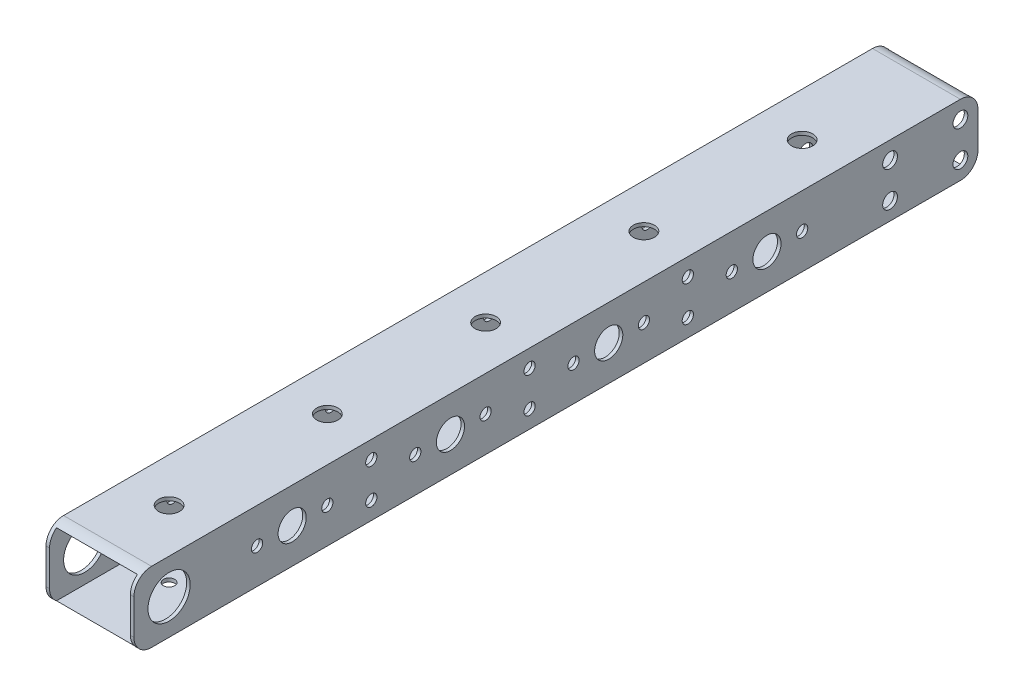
ISO-10303-21;
HEADER;
FILE_DESCRIPTION(('STEP AP214'),'2;1');
FILE_NAME('part.step','',(''),(''),'','','');
FILE_SCHEMA(('AUTOMOTIVE_DESIGN { 1 0 10303 214 1 1 1 1 }'));
ENDSEC;
DATA;
#1=APPLICATION_CONTEXT('core data for automotive mechanical design processes');
#2=APPLICATION_PROTOCOL_DEFINITION('international standard','automotive_design',2000,#1);
#3=PRODUCT_CONTEXT('',#1,'mechanical');
#4=PRODUCT('Part','Part','',(#3));
#5=PRODUCT_RELATED_PRODUCT_CATEGORY('part','',(#4));
#6=PRODUCT_DEFINITION_FORMATION('','',#4);
#7=PRODUCT_DEFINITION_CONTEXT('part definition',#1,'design');
#8=PRODUCT_DEFINITION('design','',#6,#7);
#9=PRODUCT_DEFINITION_SHAPE('','',#8);
#10=(LENGTH_UNIT() NAMED_UNIT(*) SI_UNIT(.MILLI.,.METRE.));
#11=(NAMED_UNIT(*) PLANE_ANGLE_UNIT() SI_UNIT($,.RADIAN.));
#12=(NAMED_UNIT(*) SI_UNIT($,.STERADIAN.) SOLID_ANGLE_UNIT());
#13=UNCERTAINTY_MEASURE_WITH_UNIT(LENGTH_MEASURE(1.E-05),#10,'distance_accuracy_value','');
#14=(GEOMETRIC_REPRESENTATION_CONTEXT(3) GLOBAL_UNCERTAINTY_ASSIGNED_CONTEXT((#13)) GLOBAL_UNIT_ASSIGNED_CONTEXT((#10,
#11,#12)) REPRESENTATION_CONTEXT('',''));
#15=CARTESIAN_POINT('',(0.,0.,0.));
#16=DIRECTION('',(0.,0.,1.));
#17=DIRECTION('',(1.,0.,0.));
#18=AXIS2_PLACEMENT_3D('',#15,#16,#17);
#19=CARTESIAN_POINT('',(-12.5,5.,5.));
#20=DIRECTION('',(1.,0.,0.));
#21=DIRECTION('',(0.,0.,-1.));
#22=AXIS2_PLACEMENT_3D('',#19,#20,#21);
#23=CYLINDRICAL_SURFACE('',#22,5.);
#24=CARTESIAN_POINT('',(-11.5,5.,5.));
#25=DIRECTION('',(1.,0.,0.));
#26=DIRECTION('',(0.,1.,0.));
#27=AXIS2_PLACEMENT_3D('',#24,#25,#26);
#28=CIRCLE('',#27,5.);
#29=CARTESIAN_POINT('',(-11.5,5.,0.));
#30=VERTEX_POINT('',#29);
#31=CARTESIAN_POINT('',(-11.5,9.,2.));
#32=VERTEX_POINT('',#31);
#33=EDGE_CURVE('E175',#30,#32,#28,.T.);
#34=ORIENTED_EDGE('',*,*,#33,.F.);
#35=DIRECTION('',(1.,0.,0.));
#36=VECTOR('',#35,1.);
#37=CARTESIAN_POINT('',(12.5,5.,0.));
#38=LINE('',#37,#36);
#39=CARTESIAN_POINT('',(-12.5,5.,0.));
#40=VERTEX_POINT('',#39);
#41=EDGE_CURVE('E158',#40,#30,#38,.T.);
#42=ORIENTED_EDGE('',*,*,#41,.F.);
#43=CARTESIAN_POINT('',(-12.5,5.,5.));
#44=DIRECTION('',(-1.,0.,0.));
#45=DIRECTION('',(0.,0.,-1.));
#46=AXIS2_PLACEMENT_3D('',#43,#44,#45);
#47=CIRCLE('',#46,5.);
#48=CARTESIAN_POINT('',(-12.5,10.,5.));
#49=VERTEX_POINT('',#48);
#50=EDGE_CURVE('E657',#49,#40,#47,.T.);
#51=ORIENTED_EDGE('',*,*,#50,.F.);
#52=DIRECTION('',(-1.,0.,0.));
#53=VECTOR('',#52,1.);
#54=CARTESIAN_POINT('',(-12.5,10.,5.));
#55=LINE('',#54,#53);
#56=CARTESIAN_POINT('',(12.5,10.,5.));
#57=VERTEX_POINT('',#56);
#58=EDGE_CURVE('E217',#57,#49,#55,.T.);
#59=ORIENTED_EDGE('',*,*,#58,.F.);
#60=CARTESIAN_POINT('',(12.5,5.,5.));
#61=DIRECTION('',(1.,0.,0.));
#62=DIRECTION('',(0.,0.,1.));
#63=AXIS2_PLACEMENT_3D('',#60,#61,#62);
#64=CIRCLE('',#63,5.);
#65=CARTESIAN_POINT('',(12.5,5.,0.));
#66=VERTEX_POINT('',#65);
#67=EDGE_CURVE('E376',#66,#57,#64,.T.);
#68=ORIENTED_EDGE('',*,*,#67,.F.);
#69=DIRECTION('',(1.,0.,0.));
#70=VECTOR('',#69,1.);
#71=CARTESIAN_POINT('',(12.5,5.,0.));
#72=LINE('',#71,#70);
#73=CARTESIAN_POINT('',(11.5,5.,0.));
#74=VERTEX_POINT('',#73);
#75=EDGE_CURVE('E201',#74,#66,#72,.T.);
#76=ORIENTED_EDGE('',*,*,#75,.F.);
#77=CARTESIAN_POINT('',(11.5,5.,5.));
#78=DIRECTION('',(-1.,0.,0.));
#79=DIRECTION('',(0.,0.,1.));
#80=AXIS2_PLACEMENT_3D('',#77,#78,#79);
#81=CIRCLE('',#80,5.);
#82=CARTESIAN_POINT('',(11.5,9.,2.));
#83=VERTEX_POINT('',#82);
#84=EDGE_CURVE('E685',#83,#74,#81,.T.);
#85=ORIENTED_EDGE('',*,*,#84,.F.);
#86=DIRECTION('',(1.,0.,0.));
#87=VECTOR('',#86,1.);
#88=CARTESIAN_POINT('',(-11.5,9.,2.));
#89=LINE('',#88,#87);
#90=EDGE_CURVE('E177',#32,#83,#89,.T.);
#91=ORIENTED_EDGE('',*,*,#90,.F.);
#92=EDGE_LOOP('',(#34,#42,#51,#59,#68,#76,#85,#91));
#93=FACE_BOUND('',#92,.T.);
#94=ADVANCED_FACE('F17',(#93),#23,.T.);
#95=CARTESIAN_POINT('',(-12.5,-5.,5.));
#96=DIRECTION('',(-1.,0.,0.));
#97=DIRECTION('',(0.,0.,1.));
#98=AXIS2_PLACEMENT_3D('',#95,#96,#97);
#99=CYLINDRICAL_SURFACE('',#98,5.);
#100=CARTESIAN_POINT('',(11.5,-5.,5.));
#101=DIRECTION('',(-1.,0.,0.));
#102=DIRECTION('',(0.,0.,1.));
#103=AXIS2_PLACEMENT_3D('',#100,#101,#102);
#104=CIRCLE('',#103,5.);
#105=CARTESIAN_POINT('',(11.5,-5.,0.));
#106=VERTEX_POINT('',#105);
#107=CARTESIAN_POINT('',(11.5,-9.,2.));
#108=VERTEX_POINT('',#107);
#109=EDGE_CURVE('E695',#106,#108,#104,.T.);
#110=ORIENTED_EDGE('',*,*,#109,.F.);
#111=DIRECTION('',(-1.,0.,0.));
#112=VECTOR('',#111,1.);
#113=CARTESIAN_POINT('',(-12.5,-5.,0.));
#114=LINE('',#113,#112);
#115=CARTESIAN_POINT('',(12.5,-5.,0.));
#116=VERTEX_POINT('',#115);
#117=EDGE_CURVE('E205',#116,#106,#114,.T.);
#118=ORIENTED_EDGE('',*,*,#117,.F.);
#119=CARTESIAN_POINT('',(12.5,-5.,5.));
#120=DIRECTION('',(1.,0.,0.));
#121=DIRECTION('',(0.,0.,1.));
#122=AXIS2_PLACEMENT_3D('',#119,#120,#121);
#123=CIRCLE('',#122,5.);
#124=CARTESIAN_POINT('',(12.5,-10.,5.));
#125=VERTEX_POINT('',#124);
#126=EDGE_CURVE('E454',#125,#116,#123,.T.);
#127=ORIENTED_EDGE('',*,*,#126,.F.);
#128=DIRECTION('',(1.,0.,0.));
#129=VECTOR('',#128,1.);
#130=CARTESIAN_POINT('',(12.5,-10.,5.));
#131=LINE('',#130,#129);
#132=CARTESIAN_POINT('',(-12.5,-10.,5.));
#133=VERTEX_POINT('',#132);
#134=EDGE_CURVE('E218',#133,#125,#131,.T.);
#135=ORIENTED_EDGE('',*,*,#134,.F.);
#136=CARTESIAN_POINT('',(-12.5,-5.,5.));
#137=DIRECTION('',(-1.,0.,0.));
#138=DIRECTION('',(0.,0.,-1.));
#139=AXIS2_PLACEMENT_3D('',#136,#137,#138);
#140=CIRCLE('',#139,5.);
#141=CARTESIAN_POINT('',(-12.5,-5.,0.));
#142=VERTEX_POINT('',#141);
#143=EDGE_CURVE('E662',#142,#133,#140,.T.);
#144=ORIENTED_EDGE('',*,*,#143,.F.);
#145=DIRECTION('',(-1.,0.,0.));
#146=VECTOR('',#145,1.);
#147=CARTESIAN_POINT('',(-12.5,-5.,0.));
#148=LINE('',#147,#146);
#149=CARTESIAN_POINT('',(-11.5,-5.,0.));
#150=VERTEX_POINT('',#149);
#151=EDGE_CURVE('E172',#150,#142,#148,.T.);
#152=ORIENTED_EDGE('',*,*,#151,.F.);
#153=CARTESIAN_POINT('',(-11.5,-5.,5.));
#154=DIRECTION('',(1.,0.,0.));
#155=DIRECTION('',(0.,1.,0.));
#156=AXIS2_PLACEMENT_3D('',#153,#154,#155);
#157=CIRCLE('',#156,5.);
#158=CARTESIAN_POINT('',(-11.5,-9.,2.));
#159=VERTEX_POINT('',#158);
#160=EDGE_CURVE('E187',#159,#150,#157,.T.);
#161=ORIENTED_EDGE('',*,*,#160,.F.);
#162=DIRECTION('',(-1.,0.,0.));
#163=VECTOR('',#162,1.);
#164=CARTESIAN_POINT('',(11.5,-9.,2.));
#165=LINE('',#164,#163);
#166=EDGE_CURVE('E11',#108,#159,#165,.T.);
#167=ORIENTED_EDGE('',*,*,#166,.F.);
#168=EDGE_LOOP('',(#110,#118,#127,#135,#144,#152,#161,#167));
#169=FACE_BOUND('',#168,.T.);
#170=ADVANCED_FACE('F706',(#169),#99,.T.);
#171=CARTESIAN_POINT('',(0.,5.,235.));
#172=DIRECTION('',(-1.,0.,0.));
#173=DIRECTION('',(0.,0.,1.));
#174=AXIS2_PLACEMENT_3D('',#171,#172,#173);
#175=CYLINDRICAL_SURFACE('',#174,5.);
#176=CARTESIAN_POINT('',(12.5,5.,235.));
#177=DIRECTION('',(1.,0.,0.));
#178=DIRECTION('',(0.,0.,1.));
#179=AXIS2_PLACEMENT_3D('',#176,#177,#178);
#180=CIRCLE('',#179,5.);
#181=CARTESIAN_POINT('',(12.5,10.,235.));
#182=VERTEX_POINT('',#181);
#183=CARTESIAN_POINT('',(12.5,5.,240.));
#184=VERTEX_POINT('',#183);
#185=EDGE_CURVE('E636',#182,#184,#180,.T.);
#186=ORIENTED_EDGE('',*,*,#185,.F.);
#187=DIRECTION('',(1.,0.,0.));
#188=VECTOR('',#187,1.);
#189=CARTESIAN_POINT('',(-12.5,10.,235.));
#190=LINE('',#189,#188);
#191=CARTESIAN_POINT('',(-12.5,10.,235.));
#192=VERTEX_POINT('',#191);
#193=EDGE_CURVE('E171',#192,#182,#190,.T.);
#194=ORIENTED_EDGE('',*,*,#193,.F.);
#195=CARTESIAN_POINT('',(-12.5,5.,235.));
#196=DIRECTION('',(-1.,0.,0.));
#197=DIRECTION('',(0.,0.,-1.));
#198=AXIS2_PLACEMENT_3D('',#195,#196,#197);
#199=CIRCLE('',#198,5.);
#200=CARTESIAN_POINT('',(-12.5,5.,240.));
#201=VERTEX_POINT('',#200);
#202=EDGE_CURVE('E652',#201,#192,#199,.T.);
#203=ORIENTED_EDGE('',*,*,#202,.F.);
#204=DIRECTION('',(-1.,0.,0.));
#205=VECTOR('',#204,1.);
#206=CARTESIAN_POINT('',(0.,5.,240.));
#207=LINE('',#206,#205);
#208=CARTESIAN_POINT('',(-11.5,5.,240.));
#209=VERTEX_POINT('',#208);
#210=EDGE_CURVE('E206',#209,#201,#207,.T.);
#211=ORIENTED_EDGE('',*,*,#210,.F.);
#212=CARTESIAN_POINT('',(-11.5,5.,235.));
#213=DIRECTION('',(1.,0.,0.));
#214=DIRECTION('',(0.,1.,0.));
#215=AXIS2_PLACEMENT_3D('',#212,#213,#214);
#216=CIRCLE('',#215,5.);
#217=CARTESIAN_POINT('',(-11.5,9.,238.));
#218=VERTEX_POINT('',#217);
#219=EDGE_CURVE('E200',#218,#209,#216,.T.);
#220=ORIENTED_EDGE('',*,*,#219,.F.);
#221=DIRECTION('',(-1.,0.,0.));
#222=VECTOR('',#221,1.);
#223=CARTESIAN_POINT('',(11.5,9.,238.));
#224=LINE('',#223,#222);
#225=CARTESIAN_POINT('',(11.5,9.,238.));
#226=VERTEX_POINT('',#225);
#227=EDGE_CURVE('E39',#226,#218,#224,.T.);
#228=ORIENTED_EDGE('',*,*,#227,.F.);
#229=CARTESIAN_POINT('',(11.5,5.,235.));
#230=DIRECTION('',(-1.,0.,0.));
#231=DIRECTION('',(0.,0.,1.));
#232=AXIS2_PLACEMENT_3D('',#229,#230,#231);
#233=CIRCLE('',#232,5.);
#234=CARTESIAN_POINT('',(11.5,5.,240.));
#235=VERTEX_POINT('',#234);
#236=EDGE_CURVE('E677',#235,#226,#233,.T.);
#237=ORIENTED_EDGE('',*,*,#236,.F.);
#238=DIRECTION('',(-1.,0.,0.));
#239=VECTOR('',#238,1.);
#240=CARTESIAN_POINT('',(0.,5.,240.));
#241=LINE('',#240,#239);
#242=EDGE_CURVE('E212',#184,#235,#241,.T.);
#243=ORIENTED_EDGE('',*,*,#242,.F.);
#244=EDGE_LOOP('',(#186,#194,#203,#211,#220,#228,#237,#243));
#245=FACE_BOUND('',#244,.T.);
#246=ADVANCED_FACE('F721',(#245),#175,.T.);
#247=CARTESIAN_POINT('',(0.,-5.,235.));
#248=DIRECTION('',(1.,0.,0.));
#249=DIRECTION('',(0.,0.,-1.));
#250=AXIS2_PLACEMENT_3D('',#247,#248,#249);
#251=CYLINDRICAL_SURFACE('',#250,5.);
#252=CARTESIAN_POINT('',(-12.5,-5.,235.));
#253=DIRECTION('',(-1.,0.,0.));
#254=DIRECTION('',(0.,0.,-1.));
#255=AXIS2_PLACEMENT_3D('',#252,#253,#254);
#256=CIRCLE('',#255,5.);
#257=CARTESIAN_POINT('',(-12.5,-10.,235.));
#258=VERTEX_POINT('',#257);
#259=CARTESIAN_POINT('',(-12.5,-5.,240.));
#260=VERTEX_POINT('',#259);
#261=EDGE_CURVE('E644',#258,#260,#256,.T.);
#262=ORIENTED_EDGE('',*,*,#261,.F.);
#263=DIRECTION('',(-1.,0.,0.));
#264=VECTOR('',#263,1.);
#265=CARTESIAN_POINT('',(-12.5,-10.,235.));
#266=LINE('',#265,#264);
#267=CARTESIAN_POINT('',(12.5,-10.,235.));
#268=VERTEX_POINT('',#267);
#269=EDGE_CURVE('E220',#268,#258,#266,.T.);
#270=ORIENTED_EDGE('',*,*,#269,.F.);
#271=CARTESIAN_POINT('',(12.5,-5.,235.));
#272=DIRECTION('',(1.,0.,0.));
#273=DIRECTION('',(0.,0.,1.));
#274=AXIS2_PLACEMENT_3D('',#271,#272,#273);
#275=CIRCLE('',#274,5.);
#276=CARTESIAN_POINT('',(12.5,-5.,240.));
#277=VERTEX_POINT('',#276);
#278=EDGE_CURVE('E622',#277,#268,#275,.T.);
#279=ORIENTED_EDGE('',*,*,#278,.F.);
#280=DIRECTION('',(1.,0.,0.));
#281=VECTOR('',#280,1.);
#282=CARTESIAN_POINT('',(0.,-5.,240.));
#283=LINE('',#282,#281);
#284=CARTESIAN_POINT('',(11.5,-5.,240.));
#285=VERTEX_POINT('',#284);
#286=EDGE_CURVE('E209',#285,#277,#283,.T.);
#287=ORIENTED_EDGE('',*,*,#286,.F.);
#288=CARTESIAN_POINT('',(11.5,-5.,235.));
#289=DIRECTION('',(-1.,0.,0.));
#290=DIRECTION('',(0.,0.,1.));
#291=AXIS2_PLACEMENT_3D('',#288,#289,#290);
#292=CIRCLE('',#291,5.);
#293=CARTESIAN_POINT('',(11.5,-9.,238.));
#294=VERTEX_POINT('',#293);
#295=EDGE_CURVE('E669',#294,#285,#292,.T.);
#296=ORIENTED_EDGE('',*,*,#295,.F.);
#297=DIRECTION('',(1.,0.,0.));
#298=VECTOR('',#297,1.);
#299=CARTESIAN_POINT('',(-11.5,-9.,238.));
#300=LINE('',#299,#298);
#301=CARTESIAN_POINT('',(-11.5,-9.,238.));
#302=VERTEX_POINT('',#301);
#303=EDGE_CURVE('E26',#302,#294,#300,.T.);
#304=ORIENTED_EDGE('',*,*,#303,.F.);
#305=CARTESIAN_POINT('',(-11.5,-5.,235.));
#306=DIRECTION('',(1.,0.,0.));
#307=DIRECTION('',(0.,1.,0.));
#308=AXIS2_PLACEMENT_3D('',#305,#306,#307);
#309=CIRCLE('',#308,5.);
#310=CARTESIAN_POINT('',(-11.5,-5.,240.));
#311=VERTEX_POINT('',#310);
#312=EDGE_CURVE('E506',#311,#302,#309,.T.);
#313=ORIENTED_EDGE('',*,*,#312,.F.);
#314=DIRECTION('',(1.,0.,0.));
#315=VECTOR('',#314,1.);
#316=CARTESIAN_POINT('',(0.,-5.,240.));
#317=LINE('',#316,#315);
#318=EDGE_CURVE('E204',#260,#311,#317,.T.);
#319=ORIENTED_EDGE('',*,*,#318,.F.);
#320=EDGE_LOOP('',(#262,#270,#279,#287,#296,#304,#313,#319));
#321=FACE_BOUND('',#320,.T.);
#322=ADVANCED_FACE('F832',(#321),#251,.T.);
#323=CARTESIAN_POINT('',(-11.5,-9.,240.));
#324=DIRECTION('',(0.,1.,0.));
#325=DIRECTION('',(1.,0.,0.));
#326=AXIS2_PLACEMENT_3D('',#323,#324,#325);
#327=PLANE('',#326);
#328=CARTESIAN_POINT('',(0.,-9.,172.5));
#329=DIRECTION('',(0.,1.,0.));
#330=DIRECTION('',(-1.,0.,0.));
#331=AXIS2_PLACEMENT_3D('',#328,#329,#330);
#332=CIRCLE('',#331,1.6);
#333=CARTESIAN_POINT('',(-1.6,-9.,172.5));
#334=VERTEX_POINT('',#333);
#335=EDGE_CURVE('E291',#334,#334,#332,.T.);
#336=ORIENTED_EDGE('',*,*,#335,.F.);
#337=EDGE_LOOP('',(#336));
#338=FACE_BOUND('',#337,.T.);
#339=CARTESIAN_POINT('',(0.,-9.,127.5));
#340=DIRECTION('',(0.,1.,0.));
#341=DIRECTION('',(-1.,0.,0.));
#342=AXIS2_PLACEMENT_3D('',#339,#340,#341);
#343=CIRCLE('',#342,1.6);
#344=CARTESIAN_POINT('',(-1.6,-9.,127.5));
#345=VERTEX_POINT('',#344);
#346=EDGE_CURVE('E266',#345,#345,#343,.T.);
#347=ORIENTED_EDGE('',*,*,#346,.F.);
#348=EDGE_LOOP('',(#347));
#349=FACE_BOUND('',#348,.T.);
#350=CARTESIAN_POINT('',(0.,-9.,82.5));
#351=DIRECTION('',(0.,1.,0.));
#352=DIRECTION('',(-1.,0.,0.));
#353=AXIS2_PLACEMENT_3D('',#350,#351,#352);
#354=CIRCLE('',#353,1.6);
#355=CARTESIAN_POINT('',(-1.6,-9.,82.5));
#356=VERTEX_POINT('',#355);
#357=EDGE_CURVE('E246',#356,#356,#354,.T.);
#358=ORIENTED_EDGE('',*,*,#357,.F.);
#359=EDGE_LOOP('',(#358));
#360=FACE_BOUND('',#359,.T.);
#361=CARTESIAN_POINT('',(0.,-9.,37.5));
#362=DIRECTION('',(0.,1.,0.));
#363=DIRECTION('',(-1.,0.,0.));
#364=AXIS2_PLACEMENT_3D('',#361,#362,#363);
#365=CIRCLE('',#364,1.6);
#366=CARTESIAN_POINT('',(-1.6,-9.,37.5));
#367=VERTEX_POINT('',#366);
#368=EDGE_CURVE('E238',#367,#367,#365,.T.);
#369=ORIENTED_EDGE('',*,*,#368,.F.);
#370=EDGE_LOOP('',(#369));
#371=FACE_BOUND('',#370,.T.);
#372=CARTESIAN_POINT('',(0.,-9.,217.5));
#373=DIRECTION('',(0.,1.,0.));
#374=DIRECTION('',(-1.,0.,0.));
#375=AXIS2_PLACEMENT_3D('',#372,#373,#374);
#376=CIRCLE('',#375,1.6);
#377=CARTESIAN_POINT('',(-1.6,-9.,217.5));
#378=VERTEX_POINT('',#377);
#379=EDGE_CURVE('E742',#378,#378,#376,.T.);
#380=ORIENTED_EDGE('',*,*,#379,.F.);
#381=EDGE_LOOP('',(#380));
#382=FACE_BOUND('',#381,.T.);
#383=DIRECTION('',(0.,0.,-1.));
#384=VECTOR('',#383,1.);
#385=CARTESIAN_POINT('',(-11.5,-9.,240.));
#386=LINE('',#385,#384);
#387=EDGE_CURVE('E194',#302,#159,#386,.T.);
#388=ORIENTED_EDGE('',*,*,#387,.F.);
#389=ORIENTED_EDGE('',*,*,#303,.T.);
#390=DIRECTION('',(0.,0.,-1.));
#391=VECTOR('',#390,1.);
#392=CARTESIAN_POINT('',(11.5,-9.,240.));
#393=LINE('',#392,#391);
#394=EDGE_CURVE('E665',#294,#108,#393,.T.);
#395=ORIENTED_EDGE('',*,*,#394,.T.);
#396=ORIENTED_EDGE('',*,*,#166,.T.);
#397=EDGE_LOOP('',(#388,#389,#395,#396));
#398=FACE_BOUND('',#397,.T.);
#399=ADVANCED_FACE('F702',(#338,#349,#360,#371,#382,#398),#327,.T.);
#400=CARTESIAN_POINT('',(-11.5,9.,240.));
#401=DIRECTION('',(0.,-1.,0.));
#402=DIRECTION('',(0.,0.,-1.));
#403=AXIS2_PLACEMENT_3D('',#400,#401,#402);
#404=PLANE('',#403);
#405=CARTESIAN_POINT('',(0.,9.,37.5));
#406=DIRECTION('',(0.,-1.,0.));
#407=DIRECTION('',(1.,0.,0.));
#408=AXIS2_PLACEMENT_3D('',#405,#406,#407);
#409=CIRCLE('',#408,3.);
#410=CARTESIAN_POINT('',(3.,9.,37.5));
#411=VERTEX_POINT('',#410);
#412=EDGE_CURVE('E2100',#411,#411,#409,.T.);
#413=ORIENTED_EDGE('',*,*,#412,.F.);
#414=EDGE_LOOP('',(#413));
#415=FACE_BOUND('',#414,.T.);
#416=CARTESIAN_POINT('',(0.,9.,217.5));
#417=DIRECTION('',(0.,-1.,0.));
#418=DIRECTION('',(1.,0.,0.));
#419=AXIS2_PLACEMENT_3D('',#416,#417,#418);
#420=CIRCLE('',#419,3.);
#421=CARTESIAN_POINT('',(3.,9.,217.5));
#422=VERTEX_POINT('',#421);
#423=EDGE_CURVE('E2118',#422,#422,#420,.T.);
#424=ORIENTED_EDGE('',*,*,#423,.F.);
#425=EDGE_LOOP('',(#424));
#426=FACE_BOUND('',#425,.T.);
#427=CARTESIAN_POINT('',(0.,9.,172.5));
#428=DIRECTION('',(0.,-1.,0.));
#429=DIRECTION('',(1.,0.,0.));
#430=AXIS2_PLACEMENT_3D('',#427,#428,#429);
#431=CIRCLE('',#430,3.);
#432=CARTESIAN_POINT('',(3.,9.,172.5));
#433=VERTEX_POINT('',#432);
#434=EDGE_CURVE('E2139',#433,#433,#431,.T.);
#435=ORIENTED_EDGE('',*,*,#434,.F.);
#436=EDGE_LOOP('',(#435));
#437=FACE_BOUND('',#436,.T.);
#438=CARTESIAN_POINT('',(0.,9.,127.5));
#439=DIRECTION('',(0.,-1.,0.));
#440=DIRECTION('',(1.,0.,0.));
#441=AXIS2_PLACEMENT_3D('',#438,#439,#440);
#442=CIRCLE('',#441,3.);
#443=CARTESIAN_POINT('',(3.,9.,127.5));
#444=VERTEX_POINT('',#443);
#445=EDGE_CURVE('E2158',#444,#444,#442,.T.);
#446=ORIENTED_EDGE('',*,*,#445,.F.);
#447=EDGE_LOOP('',(#446));
#448=FACE_BOUND('',#447,.T.);
#449=CARTESIAN_POINT('',(0.,9.,82.5));
#450=DIRECTION('',(0.,-1.,0.));
#451=DIRECTION('',(1.,0.,0.));
#452=AXIS2_PLACEMENT_3D('',#449,#450,#451);
#453=CIRCLE('',#452,3.);
#454=CARTESIAN_POINT('',(3.,9.,82.5));
#455=VERTEX_POINT('',#454);
#456=EDGE_CURVE('E2177',#455,#455,#453,.T.);
#457=ORIENTED_EDGE('',*,*,#456,.F.);
#458=EDGE_LOOP('',(#457));
#459=FACE_BOUND('',#458,.T.);
#460=DIRECTION('',(0.,0.,-1.));
#461=VECTOR('',#460,1.);
#462=CARTESIAN_POINT('',(11.5,9.,240.));
#463=LINE('',#462,#461);
#464=EDGE_CURVE('E681',#226,#83,#463,.T.);
#465=ORIENTED_EDGE('',*,*,#464,.F.);
#466=ORIENTED_EDGE('',*,*,#227,.T.);
#467=DIRECTION('',(0.,0.,-1.));
#468=VECTOR('',#467,1.);
#469=CARTESIAN_POINT('',(-11.5,9.,240.));
#470=LINE('',#469,#468);
#471=EDGE_CURVE('E181',#218,#32,#470,.T.);
#472=ORIENTED_EDGE('',*,*,#471,.T.);
#473=ORIENTED_EDGE('',*,*,#90,.T.);
#474=EDGE_LOOP('',(#465,#466,#472,#473));
#475=FACE_BOUND('',#474,.T.);
#476=ADVANCED_FACE('F836',(#415,#426,#437,#448,#459,#475),#404,.T.);
#477=CARTESIAN_POINT('',(-12.5,-10.,240.));
#478=DIRECTION('',(0.,1.,0.));
#479=DIRECTION('',(1.,0.,0.));
#480=AXIS2_PLACEMENT_3D('',#477,#478,#479);
#481=PLANE('',#480);
#482=CARTESIAN_POINT('',(0.,-10.,172.5));
#483=DIRECTION('',(0.,1.,0.));
#484=DIRECTION('',(0.,0.,1.));
#485=AXIS2_PLACEMENT_3D('',#482,#483,#484);
#486=CIRCLE('',#485,1.6);
#487=CARTESIAN_POINT('',(0.,-10.,174.1));
#488=VERTEX_POINT('',#487);
#489=EDGE_CURVE('E270',#488,#488,#486,.T.);
#490=ORIENTED_EDGE('',*,*,#489,.T.);
#491=EDGE_LOOP('',(#490));
#492=FACE_BOUND('',#491,.T.);
#493=CARTESIAN_POINT('',(0.,-10.,127.5));
#494=DIRECTION('',(0.,1.,0.));
#495=DIRECTION('',(0.,0.,1.));
#496=AXIS2_PLACEMENT_3D('',#493,#494,#495);
#497=CIRCLE('',#496,1.6);
#498=CARTESIAN_POINT('',(0.,-10.,129.1));
#499=VERTEX_POINT('',#498);
#500=EDGE_CURVE('E256',#499,#499,#497,.T.);
#501=ORIENTED_EDGE('',*,*,#500,.T.);
#502=EDGE_LOOP('',(#501));
#503=FACE_BOUND('',#502,.T.);
#504=CARTESIAN_POINT('',(0.,-10.,82.5));
#505=DIRECTION('',(0.,1.,0.));
#506=DIRECTION('',(0.,0.,1.));
#507=AXIS2_PLACEMENT_3D('',#504,#505,#506);
#508=CIRCLE('',#507,1.6);
#509=CARTESIAN_POINT('',(0.,-10.,84.1));
#510=VERTEX_POINT('',#509);
#511=EDGE_CURVE('E242',#510,#510,#508,.T.);
#512=ORIENTED_EDGE('',*,*,#511,.T.);
#513=EDGE_LOOP('',(#512));
#514=FACE_BOUND('',#513,.T.);
#515=CARTESIAN_POINT('',(0.,-10.,37.5));
#516=DIRECTION('',(0.,1.,0.));
#517=DIRECTION('',(0.,0.,1.));
#518=AXIS2_PLACEMENT_3D('',#515,#516,#517);
#519=CIRCLE('',#518,1.6);
#520=CARTESIAN_POINT('',(0.,-10.,39.1));
#521=VERTEX_POINT('',#520);
#522=EDGE_CURVE('E236',#521,#521,#519,.T.);
#523=ORIENTED_EDGE('',*,*,#522,.T.);
#524=EDGE_LOOP('',(#523));
#525=FACE_BOUND('',#524,.T.);
#526=CARTESIAN_POINT('',(0.,-10.,217.5));
#527=DIRECTION('',(0.,1.,0.));
#528=DIRECTION('',(0.,0.,1.));
#529=AXIS2_PLACEMENT_3D('',#526,#527,#528);
#530=CIRCLE('',#529,1.6);
#531=CARTESIAN_POINT('',(0.,-10.,219.1));
#532=VERTEX_POINT('',#531);
#533=EDGE_CURVE('E738',#532,#532,#530,.T.);
#534=ORIENTED_EDGE('',*,*,#533,.T.);
#535=EDGE_LOOP('',(#534));
#536=FACE_BOUND('',#535,.T.);
#537=DIRECTION('',(0.,0.,-1.));
#538=VECTOR('',#537,1.);
#539=CARTESIAN_POINT('',(12.5,-10.,240.));
#540=LINE('',#539,#538);
#541=EDGE_CURVE('E626',#268,#125,#540,.T.);
#542=ORIENTED_EDGE('',*,*,#541,.F.);
#543=ORIENTED_EDGE('',*,*,#269,.T.);
#544=DIRECTION('',(0.,0.,-1.));
#545=VECTOR('',#544,1.);
#546=CARTESIAN_POINT('',(-12.5,-10.,240.));
#547=LINE('',#546,#545);
#548=EDGE_CURVE('E640',#258,#133,#547,.T.);
#549=ORIENTED_EDGE('',*,*,#548,.T.);
#550=ORIENTED_EDGE('',*,*,#134,.T.);
#551=EDGE_LOOP('',(#542,#543,#549,#550));
#552=FACE_BOUND('',#551,.T.);
#553=ADVANCED_FACE('F825',(#492,#503,#514,#525,#536,#552),#481,.F.);
#554=CARTESIAN_POINT('',(-12.5,10.,240.));
#555=DIRECTION('',(0.,-1.,0.));
#556=DIRECTION('',(0.,0.,-1.));
#557=AXIS2_PLACEMENT_3D('',#554,#555,#556);
#558=PLANE('',#557);
#559=CARTESIAN_POINT('',(0.,10.,37.5));
#560=DIRECTION('',(0.,1.,0.));
#561=DIRECTION('',(0.,0.,1.));
#562=AXIS2_PLACEMENT_3D('',#559,#560,#561);
#563=CIRCLE('',#562,3.);
#564=CARTESIAN_POINT('',(0.,10.,40.5));
#565=VERTEX_POINT('',#564);
#566=EDGE_CURVE('E743',#565,#565,#563,.T.);
#567=ORIENTED_EDGE('',*,*,#566,.F.);
#568=EDGE_LOOP('',(#567));
#569=FACE_BOUND('',#568,.T.);
#570=CARTESIAN_POINT('',(0.,10.,217.5));
#571=DIRECTION('',(0.,1.,0.));
#572=DIRECTION('',(0.,0.,1.));
#573=AXIS2_PLACEMENT_3D('',#570,#571,#572);
#574=CIRCLE('',#573,3.);
#575=CARTESIAN_POINT('',(0.,10.,220.5));
#576=VERTEX_POINT('',#575);
#577=EDGE_CURVE('E2109',#576,#576,#574,.T.);
#578=ORIENTED_EDGE('',*,*,#577,.F.);
#579=EDGE_LOOP('',(#578));
#580=FACE_BOUND('',#579,.T.);
#581=CARTESIAN_POINT('',(0.,10.,172.5));
#582=DIRECTION('',(0.,1.,0.));
#583=DIRECTION('',(0.,0.,1.));
#584=AXIS2_PLACEMENT_3D('',#581,#582,#583);
#585=CIRCLE('',#584,3.);
#586=CARTESIAN_POINT('',(0.,10.,175.5));
#587=VERTEX_POINT('',#586);
#588=EDGE_CURVE('E2128',#587,#587,#585,.T.);
#589=ORIENTED_EDGE('',*,*,#588,.F.);
#590=EDGE_LOOP('',(#589));
#591=FACE_BOUND('',#590,.T.);
#592=CARTESIAN_POINT('',(0.,10.,127.5));
#593=DIRECTION('',(0.,1.,0.));
#594=DIRECTION('',(0.,0.,1.));
#595=AXIS2_PLACEMENT_3D('',#592,#593,#594);
#596=CIRCLE('',#595,3.);
#597=CARTESIAN_POINT('',(0.,10.,130.5));
#598=VERTEX_POINT('',#597);
#599=EDGE_CURVE('E2149',#598,#598,#596,.T.);
#600=ORIENTED_EDGE('',*,*,#599,.F.);
#601=EDGE_LOOP('',(#600));
#602=FACE_BOUND('',#601,.T.);
#603=CARTESIAN_POINT('',(0.,10.,82.5));
#604=DIRECTION('',(0.,1.,0.));
#605=DIRECTION('',(0.,0.,1.));
#606=AXIS2_PLACEMENT_3D('',#603,#604,#605);
#607=CIRCLE('',#606,3.);
#608=CARTESIAN_POINT('',(0.,10.,85.5));
#609=VERTEX_POINT('',#608);
#610=EDGE_CURVE('E2167',#609,#609,#607,.T.);
#611=ORIENTED_EDGE('',*,*,#610,.F.);
#612=EDGE_LOOP('',(#611));
#613=FACE_BOUND('',#612,.T.);
#614=DIRECTION('',(0.,0.,-1.));
#615=VECTOR('',#614,1.);
#616=CARTESIAN_POINT('',(-12.5,10.,240.));
#617=LINE('',#616,#615);
#618=EDGE_CURVE('E653',#192,#49,#617,.T.);
#619=ORIENTED_EDGE('',*,*,#618,.F.);
#620=ORIENTED_EDGE('',*,*,#193,.T.);
#621=DIRECTION('',(0.,0.,-1.));
#622=VECTOR('',#621,1.);
#623=CARTESIAN_POINT('',(12.5,10.,240.));
#624=LINE('',#623,#622);
#625=EDGE_CURVE('E380',#182,#57,#624,.T.);
#626=ORIENTED_EDGE('',*,*,#625,.T.);
#627=ORIENTED_EDGE('',*,*,#58,.T.);
#628=EDGE_LOOP('',(#619,#620,#626,#627));
#629=FACE_BOUND('',#628,.T.);
#630=ADVANCED_FACE('F726',(#569,#580,#591,#602,#613,#629),#558,.F.);
#631=CARTESIAN_POINT('',(0.,0.,0.));
#632=DIRECTION('',(0.,0.,-1.));
#633=DIRECTION('',(0.,-1.,0.));
#634=AXIS2_PLACEMENT_3D('',#631,#632,#633);
#635=PLANE('',#634);
#636=DIRECTION('',(0.,-1.,0.));
#637=VECTOR('',#636,1.);
#638=CARTESIAN_POINT('',(-11.5,-9.,0.));
#639=LINE('',#638,#637);
#640=EDGE_CURVE('E163',#30,#150,#639,.T.);
#641=ORIENTED_EDGE('',*,*,#640,.T.);
#642=ORIENTED_EDGE('',*,*,#151,.T.);
#643=DIRECTION('',(0.,-1.,0.));
#644=VECTOR('',#643,1.);
#645=CARTESIAN_POINT('',(-12.5,-10.,0.));
#646=LINE('',#645,#644);
#647=EDGE_CURVE('E166',#40,#142,#646,.T.);
#648=ORIENTED_EDGE('',*,*,#647,.F.);
#649=ORIENTED_EDGE('',*,*,#41,.T.);
#650=EDGE_LOOP('',(#641,#642,#648,#649));
#651=FACE_BOUND('',#650,.T.);
#652=ADVANCED_FACE('F160',(#651),#635,.T.);
#653=CARTESIAN_POINT('',(0.,0.,240.));
#654=DIRECTION('',(0.,0.,-1.));
#655=DIRECTION('',(0.,-1.,0.));
#656=AXIS2_PLACEMENT_3D('',#653,#654,#655);
#657=PLANE('',#656);
#658=DIRECTION('',(0.,1.,0.));
#659=VECTOR('',#658,1.);
#660=CARTESIAN_POINT('',(11.5,-9.,240.));
#661=LINE('',#660,#659);
#662=EDGE_CURVE('E673',#285,#235,#661,.T.);
#663=ORIENTED_EDGE('',*,*,#662,.F.);
#664=ORIENTED_EDGE('',*,*,#286,.T.);
#665=DIRECTION('',(0.,1.,0.));
#666=VECTOR('',#665,1.);
#667=CARTESIAN_POINT('',(12.5,-10.,240.));
#668=LINE('',#667,#666);
#669=EDGE_CURVE('E618',#277,#184,#668,.T.);
#670=ORIENTED_EDGE('',*,*,#669,.T.);
#671=ORIENTED_EDGE('',*,*,#242,.T.);
#672=EDGE_LOOP('',(#663,#664,#670,#671));
#673=FACE_BOUND('',#672,.T.);
#674=ADVANCED_FACE('F829',(#673),#657,.F.);
#675=CARTESIAN_POINT('',(0.,0.,240.));
#676=DIRECTION('',(0.,0.,-1.));
#677=DIRECTION('',(0.,-1.,0.));
#678=AXIS2_PLACEMENT_3D('',#675,#676,#677);
#679=PLANE('',#678);
#680=DIRECTION('',(0.,-1.,0.));
#681=VECTOR('',#680,1.);
#682=CARTESIAN_POINT('',(-12.5,-10.,240.));
#683=LINE('',#682,#681);
#684=EDGE_CURVE('E648',#201,#260,#683,.T.);
#685=ORIENTED_EDGE('',*,*,#684,.T.);
#686=ORIENTED_EDGE('',*,*,#318,.T.);
#687=DIRECTION('',(0.,-1.,0.));
#688=VECTOR('',#687,1.);
#689=CARTESIAN_POINT('',(-11.5,-9.,240.));
#690=LINE('',#689,#688);
#691=EDGE_CURVE('E510',#209,#311,#690,.T.);
#692=ORIENTED_EDGE('',*,*,#691,.F.);
#693=ORIENTED_EDGE('',*,*,#210,.T.);
#694=EDGE_LOOP('',(#685,#686,#692,#693));
#695=FACE_BOUND('',#694,.T.);
#696=ADVANCED_FACE('F835',(#695),#679,.F.);
#697=CARTESIAN_POINT('',(0.,0.,0.));
#698=DIRECTION('',(0.,0.,-1.));
#699=DIRECTION('',(0.,-1.,0.));
#700=AXIS2_PLACEMENT_3D('',#697,#698,#699);
#701=PLANE('',#700);
#702=DIRECTION('',(0.,1.,0.));
#703=VECTOR('',#702,1.);
#704=CARTESIAN_POINT('',(12.5,-10.,0.));
#705=LINE('',#704,#703);
#706=EDGE_CURVE('E381',#116,#66,#705,.T.);
#707=ORIENTED_EDGE('',*,*,#706,.F.);
#708=ORIENTED_EDGE('',*,*,#117,.T.);
#709=DIRECTION('',(0.,1.,0.));
#710=VECTOR('',#709,1.);
#711=CARTESIAN_POINT('',(11.5,-9.,0.));
#712=LINE('',#711,#710);
#713=EDGE_CURVE('E691',#106,#74,#712,.T.);
#714=ORIENTED_EDGE('',*,*,#713,.T.);
#715=ORIENTED_EDGE('',*,*,#75,.T.);
#716=EDGE_LOOP('',(#707,#708,#714,#715));
#717=FACE_BOUND('',#716,.T.);
#718=ADVANCED_FACE('F817',(#717),#701,.T.);
#719=CARTESIAN_POINT('',(-11.5,-9.,240.));
#720=DIRECTION('',(1.,0.,0.));
#721=DIRECTION('',(0.,1.,0.));
#722=AXIS2_PLACEMENT_3D('',#719,#720,#721);
#723=PLANE('',#722);
#724=CARTESIAN_POINT('',(-11.5,5.,82.5));
#725=DIRECTION('',(1.,0.,0.));
#726=DIRECTION('',(0.,1.,0.));
#727=AXIS2_PLACEMENT_3D('',#724,#725,#726);
#728=CIRCLE('',#727,1.6);
#729=CARTESIAN_POINT('',(-11.5,6.6,82.5));
#730=VERTEX_POINT('',#729);
#731=EDGE_CURVE('E375',#730,#730,#728,.T.);
#732=ORIENTED_EDGE('',*,*,#731,.F.);
#733=EDGE_LOOP('',(#732));
#734=FACE_BOUND('',#733,.T.);
#735=CARTESIAN_POINT('',(-11.5,-5.,5.));
#736=DIRECTION('',(-1.,0.,0.));
#737=DIRECTION('',(0.,1.,0.));
#738=AXIS2_PLACEMENT_3D('',#735,#736,#737);
#739=CIRCLE('',#738,2.09999999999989);
#740=CARTESIAN_POINT('',(-11.5,-2.90000000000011,5.));
#741=VERTEX_POINT('',#740);
#742=EDGE_CURVE('E588',#741,#741,#739,.T.);
#743=ORIENTED_EDGE('',*,*,#742,.T.);
#744=EDGE_LOOP('',(#743));
#745=FACE_BOUND('',#744,.T.);
#746=CARTESIAN_POINT('',(-11.5,-5.,25.));
#747=DIRECTION('',(1.,0.,0.));
#748=DIRECTION('',(0.,1.,0.));
#749=AXIS2_PLACEMENT_3D('',#746,#747,#748);
#750=CIRCLE('',#749,2.10000000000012);
#751=CARTESIAN_POINT('',(-11.5,-2.89999999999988,25.));
#752=VERTEX_POINT('',#751);
#753=EDGE_CURVE('E596',#752,#752,#750,.T.);
#754=ORIENTED_EDGE('',*,*,#753,.F.);
#755=EDGE_LOOP('',(#754));
#756=FACE_BOUND('',#755,.T.);
#757=CARTESIAN_POINT('',(-11.5,5.,5.));
#758=DIRECTION('',(1.,0.,0.));
#759=DIRECTION('',(0.,1.,0.));
#760=AXIS2_PLACEMENT_3D('',#757,#758,#759);
#761=CIRCLE('',#760,2.1);
#762=CARTESIAN_POINT('',(-11.5,7.1,5.));
#763=VERTEX_POINT('',#762);
#764=EDGE_CURVE('E614',#763,#763,#761,.T.);
#765=ORIENTED_EDGE('',*,*,#764,.F.);
#766=EDGE_LOOP('',(#765));
#767=FACE_BOUND('',#766,.T.);
#768=CARTESIAN_POINT('',(-11.5,5.,25.));
#769=DIRECTION('',(-1.,0.,0.));
#770=DIRECTION('',(0.,1.,0.));
#771=AXIS2_PLACEMENT_3D('',#768,#769,#770);
#772=CIRCLE('',#771,2.1);
#773=CARTESIAN_POINT('',(-11.5,7.1,25.));
#774=VERTEX_POINT('',#773);
#775=EDGE_CURVE('E606',#774,#774,#772,.T.);
#776=ORIENTED_EDGE('',*,*,#775,.T.);
#777=EDGE_LOOP('',(#776));
#778=FACE_BOUND('',#777,.T.);
#779=CARTESIAN_POINT('',(-11.5,0.,230.));
#780=DIRECTION('',(1.,0.,0.));
#781=DIRECTION('',(0.,1.,0.));
#782=AXIS2_PLACEMENT_3D('',#779,#780,#781);
#783=CIRCLE('',#782,6.);
#784=CARTESIAN_POINT('',(-11.5,6.,230.));
#785=VERTEX_POINT('',#784);
#786=EDGE_CURVE('E551',#785,#785,#783,.T.);
#787=ORIENTED_EDGE('',*,*,#786,.F.);
#788=EDGE_LOOP('',(#787));
#789=FACE_BOUND('',#788,.T.);
#790=CARTESIAN_POINT('',(-11.5,0.,70.));
#791=DIRECTION('',(1.,0.,0.));
#792=DIRECTION('',(0.,1.,0.));
#793=AXIS2_PLACEMENT_3D('',#790,#791,#792);
#794=CIRCLE('',#793,1.6);
#795=CARTESIAN_POINT('',(-11.5,1.6,70.));
#796=VERTEX_POINT('',#795);
#797=EDGE_CURVE('E537',#796,#796,#794,.T.);
#798=ORIENTED_EDGE('',*,*,#797,.F.);
#799=EDGE_LOOP('',(#798));
#800=FACE_BOUND('',#799,.T.);
#801=CARTESIAN_POINT('',(-11.5,0.,60.));
#802=DIRECTION('',(1.,0.,0.));
#803=DIRECTION('',(0.,1.,0.));
#804=AXIS2_PLACEMENT_3D('',#801,#802,#803);
#805=CIRCLE('',#804,4.);
#806=CARTESIAN_POINT('',(-11.5,4.,60.));
#807=VERTEX_POINT('',#806);
#808=EDGE_CURVE('E529',#807,#807,#805,.T.);
#809=ORIENTED_EDGE('',*,*,#808,.F.);
#810=EDGE_LOOP('',(#809));
#811=FACE_BOUND('',#810,.T.);
#812=CARTESIAN_POINT('',(-11.5,0.,50.));
#813=DIRECTION('',(1.,0.,0.));
#814=DIRECTION('',(0.,1.,0.));
#815=AXIS2_PLACEMENT_3D('',#812,#813,#814);
#816=CIRCLE('',#815,1.6);
#817=CARTESIAN_POINT('',(-11.5,1.6,50.));
#818=VERTEX_POINT('',#817);
#819=EDGE_CURVE('E521',#818,#818,#816,.T.);
#820=ORIENTED_EDGE('',*,*,#819,.F.);
#821=EDGE_LOOP('',(#820));
#822=FACE_BOUND('',#821,.T.);
#823=CARTESIAN_POINT('',(-11.5,0.,195.));
#824=DIRECTION('',(1.,0.,0.));
#825=DIRECTION('',(0.,1.,0.));
#826=AXIS2_PLACEMENT_3D('',#823,#824,#825);
#827=CIRCLE('',#826,4.);
#828=CARTESIAN_POINT('',(-11.5,4.,195.));
#829=VERTEX_POINT('',#828);
#830=EDGE_CURVE('E296',#829,#829,#827,.T.);
#831=ORIENTED_EDGE('',*,*,#830,.F.);
#832=EDGE_LOOP('',(#831));
#833=FACE_BOUND('',#832,.T.);
#834=CARTESIAN_POINT('',(-11.5,0.,185.));
#835=DIRECTION('',(1.,0.,0.));
#836=DIRECTION('',(0.,1.,0.));
#837=AXIS2_PLACEMENT_3D('',#834,#835,#836);
#838=CIRCLE('',#837,1.6);
#839=CARTESIAN_POINT('',(-11.5,1.6,185.));
#840=VERTEX_POINT('',#839);
#841=EDGE_CURVE('E297',#840,#840,#838,.T.);
#842=ORIENTED_EDGE('',*,*,#841,.F.);
#843=EDGE_LOOP('',(#842));
#844=FACE_BOUND('',#843,.T.);
#845=CARTESIAN_POINT('',(-11.5,0.,150.));
#846=DIRECTION('',(1.,0.,0.));
#847=DIRECTION('',(0.,1.,0.));
#848=AXIS2_PLACEMENT_3D('',#845,#846,#847);
#849=CIRCLE('',#848,4.);
#850=CARTESIAN_POINT('',(-11.5,4.,150.));
#851=VERTEX_POINT('',#850);
#852=EDGE_CURVE('E347',#851,#851,#849,.T.);
#853=ORIENTED_EDGE('',*,*,#852,.F.);
#854=EDGE_LOOP('',(#853));
#855=FACE_BOUND('',#854,.T.);
#856=CARTESIAN_POINT('',(-11.5,0.,140.));
#857=DIRECTION('',(1.,0.,0.));
#858=DIRECTION('',(0.,1.,0.));
#859=AXIS2_PLACEMENT_3D('',#856,#857,#858);
#860=CIRCLE('',#859,1.6);
#861=CARTESIAN_POINT('',(-11.5,1.6,140.));
#862=VERTEX_POINT('',#861);
#863=EDGE_CURVE('E491',#862,#862,#860,.T.);
#864=ORIENTED_EDGE('',*,*,#863,.F.);
#865=EDGE_LOOP('',(#864));
#866=FACE_BOUND('',#865,.T.);
#867=CARTESIAN_POINT('',(-11.5,0.,115.));
#868=DIRECTION('',(1.,0.,0.));
#869=DIRECTION('',(0.,1.,0.));
#870=AXIS2_PLACEMENT_3D('',#867,#868,#869);
#871=CIRCLE('',#870,1.59999999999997);
#872=CARTESIAN_POINT('',(-11.5,1.59999999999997,115.));
#873=VERTEX_POINT('',#872);
#874=EDGE_CURVE('E495',#873,#873,#871,.T.);
#875=ORIENTED_EDGE('',*,*,#874,.F.);
#876=EDGE_LOOP('',(#875));
#877=FACE_BOUND('',#876,.T.);
#878=CARTESIAN_POINT('',(-11.5,0.,105.));
#879=DIRECTION('',(1.,0.,0.));
#880=DIRECTION('',(0.,1.,0.));
#881=AXIS2_PLACEMENT_3D('',#878,#879,#880);
#882=CIRCLE('',#881,4.);
#883=CARTESIAN_POINT('',(-11.5,4.,105.));
#884=VERTEX_POINT('',#883);
#885=EDGE_CURVE('E480',#884,#884,#882,.T.);
#886=ORIENTED_EDGE('',*,*,#885,.F.);
#887=EDGE_LOOP('',(#886));
#888=FACE_BOUND('',#887,.T.);
#889=CARTESIAN_POINT('',(-11.5,0.,95.));
#890=DIRECTION('',(1.,0.,0.));
#891=DIRECTION('',(0.,1.,0.));
#892=AXIS2_PLACEMENT_3D('',#889,#890,#891);
#893=CIRCLE('',#892,1.6);
#894=CARTESIAN_POINT('',(-11.5,1.6,95.));
#895=VERTEX_POINT('',#894);
#896=EDGE_CURVE('E404',#895,#895,#893,.T.);
#897=ORIENTED_EDGE('',*,*,#896,.F.);
#898=EDGE_LOOP('',(#897));
#899=FACE_BOUND('',#898,.T.);
#900=CARTESIAN_POINT('',(-11.5,0.,160.));
#901=DIRECTION('',(1.,0.,0.));
#902=DIRECTION('',(0.,1.,0.));
#903=AXIS2_PLACEMENT_3D('',#900,#901,#902);
#904=CIRCLE('',#903,1.59999999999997);
#905=CARTESIAN_POINT('',(-11.5,1.59999999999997,160.));
#906=VERTEX_POINT('',#905);
#907=EDGE_CURVE('E470',#906,#906,#904,.T.);
#908=ORIENTED_EDGE('',*,*,#907,.F.);
#909=EDGE_LOOP('',(#908));
#910=FACE_BOUND('',#909,.T.);
#911=CARTESIAN_POINT('',(-11.5,0.,205.));
#912=DIRECTION('',(1.,0.,0.));
#913=DIRECTION('',(0.,1.,0.));
#914=AXIS2_PLACEMENT_3D('',#911,#912,#913);
#915=CIRCLE('',#914,1.59999999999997);
#916=CARTESIAN_POINT('',(-11.5,1.59999999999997,205.));
#917=VERTEX_POINT('',#916);
#918=EDGE_CURVE('E462',#917,#917,#915,.T.);
#919=ORIENTED_EDGE('',*,*,#918,.F.);
#920=EDGE_LOOP('',(#919));
#921=FACE_BOUND('',#920,.T.);
#922=CARTESIAN_POINT('',(-11.5,-5.,82.5));
#923=DIRECTION('',(-1.,0.,0.));
#924=DIRECTION('',(0.,1.,0.));
#925=AXIS2_PLACEMENT_3D('',#922,#923,#924);
#926=CIRCLE('',#925,1.6);
#927=CARTESIAN_POINT('',(-11.5,-3.4,82.5));
#928=VERTEX_POINT('',#927);
#929=EDGE_CURVE('E395',#928,#928,#926,.T.);
#930=ORIENTED_EDGE('',*,*,#929,.T.);
#931=EDGE_LOOP('',(#930));
#932=FACE_BOUND('',#931,.T.);
#933=CARTESIAN_POINT('',(-11.5,-5.,127.5));
#934=DIRECTION('',(-1.,0.,0.));
#935=DIRECTION('',(0.,1.,0.));
#936=AXIS2_PLACEMENT_3D('',#933,#934,#935);
#937=CIRCLE('',#936,1.6);
#938=CARTESIAN_POINT('',(-11.5,-3.4,127.5));
#939=VERTEX_POINT('',#938);
#940=EDGE_CURVE('E354',#939,#939,#937,.T.);
#941=ORIENTED_EDGE('',*,*,#940,.T.);
#942=EDGE_LOOP('',(#941));
#943=FACE_BOUND('',#942,.T.);
#944=CARTESIAN_POINT('',(-11.5,-5.,172.5));
#945=DIRECTION('',(-1.,0.,0.));
#946=DIRECTION('',(0.,1.,0.));
#947=AXIS2_PLACEMENT_3D('',#944,#945,#946);
#948=CIRCLE('',#947,1.6);
#949=CARTESIAN_POINT('',(-11.5,-3.4,172.5));
#950=VERTEX_POINT('',#949);
#951=EDGE_CURVE('E334',#950,#950,#948,.T.);
#952=ORIENTED_EDGE('',*,*,#951,.T.);
#953=EDGE_LOOP('',(#952));
#954=FACE_BOUND('',#953,.T.);
#955=CARTESIAN_POINT('',(-11.5,5.,127.5));
#956=DIRECTION('',(1.,0.,0.));
#957=DIRECTION('',(0.,1.,0.));
#958=AXIS2_PLACEMENT_3D('',#955,#956,#957);
#959=CIRCLE('',#958,1.6);
#960=CARTESIAN_POINT('',(-11.5,6.6,127.5));
#961=VERTEX_POINT('',#960);
#962=EDGE_CURVE('E261',#961,#961,#959,.T.);
#963=ORIENTED_EDGE('',*,*,#962,.F.);
#964=EDGE_LOOP('',(#963));
#965=FACE_BOUND('',#964,.T.);
#966=CARTESIAN_POINT('',(-11.5,5.,172.5));
#967=DIRECTION('',(1.,0.,0.));
#968=DIRECTION('',(0.,1.,0.));
#969=AXIS2_PLACEMENT_3D('',#966,#967,#968);
#970=CIRCLE('',#969,1.6);
#971=CARTESIAN_POINT('',(-11.5,6.6,172.5));
#972=VERTEX_POINT('',#971);
#973=EDGE_CURVE('E262',#972,#972,#970,.T.);
#974=ORIENTED_EDGE('',*,*,#973,.F.);
#975=EDGE_LOOP('',(#974));
#976=FACE_BOUND('',#975,.T.);
#977=ORIENTED_EDGE('',*,*,#691,.T.);
#978=ORIENTED_EDGE('',*,*,#312,.T.);
#979=ORIENTED_EDGE('',*,*,#387,.T.);
#980=ORIENTED_EDGE('',*,*,#160,.T.);
#981=ORIENTED_EDGE('',*,*,#640,.F.);
#982=ORIENTED_EDGE('',*,*,#33,.T.);
#983=ORIENTED_EDGE('',*,*,#471,.F.);
#984=ORIENTED_EDGE('',*,*,#219,.T.);
#985=EDGE_LOOP('',(#977,#978,#979,#980,#981,#982,#983,#984));
#986=FACE_BOUND('',#985,.T.);
#987=ADVANCED_FACE('F184',(#734,#745,#756,#767,#778,#789,#800,#811,#822,#833,#844,#855,#866,
#877,#888,#899,#910,#921,#932,#943,#954,#965,#976,#986),#723,.T.);
#988=CARTESIAN_POINT('',(11.5,-9.,240.));
#989=DIRECTION('',(-1.,0.,0.));
#990=DIRECTION('',(0.,0.,1.));
#991=AXIS2_PLACEMENT_3D('',#988,#989,#990);
#992=PLANE('',#991);
#993=CARTESIAN_POINT('',(11.5,5.,82.5));
#994=DIRECTION('',(-1.,0.,0.));
#995=DIRECTION('',(0.,0.,1.));
#996=AXIS2_PLACEMENT_3D('',#993,#994,#995);
#997=CIRCLE('',#996,1.6);
#998=CARTESIAN_POINT('',(11.5,5.,84.1));
#999=VERTEX_POINT('',#998);
#1000=EDGE_CURVE('E363',#999,#999,#997,.T.);
#1001=ORIENTED_EDGE('',*,*,#1000,.F.);
#1002=EDGE_LOOP('',(#1001));
#1003=FACE_BOUND('',#1002,.T.);
#1004=CARTESIAN_POINT('',(11.5,-5.,5.));
#1005=DIRECTION('',(1.,0.,0.));
#1006=DIRECTION('',(0.,0.,1.));
#1007=AXIS2_PLACEMENT_3D('',#1004,#1005,#1006);
#1008=CIRCLE('',#1007,2.09999999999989);
#1009=CARTESIAN_POINT('',(11.5,-5.,7.09999999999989));
#1010=VERTEX_POINT('',#1009);
#1011=EDGE_CURVE('E555',#1010,#1010,#1008,.T.);
#1012=ORIENTED_EDGE('',*,*,#1011,.T.);
#1013=EDGE_LOOP('',(#1012));
#1014=FACE_BOUND('',#1013,.T.);
#1015=CARTESIAN_POINT('',(11.5,-5.,25.));
#1016=DIRECTION('',(-1.,0.,0.));
#1017=DIRECTION('',(0.,0.,1.));
#1018=AXIS2_PLACEMENT_3D('',#1015,#1016,#1017);
#1019=CIRCLE('',#1018,2.10000000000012);
#1020=CARTESIAN_POINT('',(11.5,-5.,27.1000000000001));
#1021=VERTEX_POINT('',#1020);
#1022=EDGE_CURVE('E563',#1021,#1021,#1019,.T.);
#1023=ORIENTED_EDGE('',*,*,#1022,.F.);
#1024=EDGE_LOOP('',(#1023));
#1025=FACE_BOUND('',#1024,.T.);
#1026=CARTESIAN_POINT('',(11.5,5.,5.));
#1027=DIRECTION('',(-1.,0.,0.));
#1028=DIRECTION('',(0.,0.,1.));
#1029=AXIS2_PLACEMENT_3D('',#1026,#1027,#1028);
#1030=CIRCLE('',#1029,2.1);
#1031=CARTESIAN_POINT('',(11.5,5.,7.1));
#1032=VERTEX_POINT('',#1031);
#1033=EDGE_CURVE('E579',#1032,#1032,#1030,.T.);
#1034=ORIENTED_EDGE('',*,*,#1033,.F.);
#1035=EDGE_LOOP('',(#1034));
#1036=FACE_BOUND('',#1035,.T.);
#1037=CARTESIAN_POINT('',(11.5,5.,25.));
#1038=DIRECTION('',(1.,0.,0.));
#1039=DIRECTION('',(0.,0.,1.));
#1040=AXIS2_PLACEMENT_3D('',#1037,#1038,#1039);
#1041=CIRCLE('',#1040,2.1);
#1042=CARTESIAN_POINT('',(11.5,5.,27.1));
#1043=VERTEX_POINT('',#1042);
#1044=EDGE_CURVE('E571',#1043,#1043,#1041,.T.);
#1045=ORIENTED_EDGE('',*,*,#1044,.T.);
#1046=EDGE_LOOP('',(#1045));
#1047=FACE_BOUND('',#1046,.T.);
#1048=CARTESIAN_POINT('',(11.5,0.,230.));
#1049=DIRECTION('',(-1.,0.,0.));
#1050=DIRECTION('',(0.,0.,1.));
#1051=AXIS2_PLACEMENT_3D('',#1048,#1049,#1050);
#1052=CIRCLE('',#1051,6.);
#1053=CARTESIAN_POINT('',(11.5,0.,236.));
#1054=VERTEX_POINT('',#1053);
#1055=EDGE_CURVE('E387',#1054,#1054,#1052,.T.);
#1056=ORIENTED_EDGE('',*,*,#1055,.F.);
#1057=EDGE_LOOP('',(#1056));
#1058=FACE_BOUND('',#1057,.T.);
#1059=CARTESIAN_POINT('',(11.5,0.,70.));
#1060=DIRECTION('',(-1.,0.,0.));
#1061=DIRECTION('',(0.,0.,1.));
#1062=AXIS2_PLACEMENT_3D('',#1059,#1060,#1061);
#1063=CIRCLE('',#1062,1.6);
#1064=CARTESIAN_POINT('',(11.5,0.,71.6));
#1065=VERTEX_POINT('',#1064);
#1066=EDGE_CURVE('E458',#1065,#1065,#1063,.T.);
#1067=ORIENTED_EDGE('',*,*,#1066,.F.);
#1068=EDGE_LOOP('',(#1067));
#1069=FACE_BOUND('',#1068,.T.);
#1070=CARTESIAN_POINT('',(11.5,0.,60.));
#1071=DIRECTION('',(-1.,0.,0.));
#1072=DIRECTION('',(0.,0.,1.));
#1073=AXIS2_PLACEMENT_3D('',#1070,#1071,#1072);
#1074=CIRCLE('',#1073,4.);
#1075=CARTESIAN_POINT('',(11.5,0.,64.));
#1076=VERTEX_POINT('',#1075);
#1077=EDGE_CURVE('E446',#1076,#1076,#1074,.T.);
#1078=ORIENTED_EDGE('',*,*,#1077,.F.);
#1079=EDGE_LOOP('',(#1078));
#1080=FACE_BOUND('',#1079,.T.);
#1081=CARTESIAN_POINT('',(11.5,0.,50.));
#1082=DIRECTION('',(-1.,0.,0.));
#1083=DIRECTION('',(0.,0.,1.));
#1084=AXIS2_PLACEMENT_3D('',#1081,#1082,#1083);
#1085=CIRCLE('',#1084,1.6);
#1086=CARTESIAN_POINT('',(11.5,0.,51.6));
#1087=VERTEX_POINT('',#1086);
#1088=EDGE_CURVE('E324',#1087,#1087,#1085,.T.);
#1089=ORIENTED_EDGE('',*,*,#1088,.F.);
#1090=EDGE_LOOP('',(#1089));
#1091=FACE_BOUND('',#1090,.T.);
#1092=CARTESIAN_POINT('',(11.5,0.,195.));
#1093=DIRECTION('',(-1.,0.,0.));
#1094=DIRECTION('',(0.,0.,1.));
#1095=AXIS2_PLACEMENT_3D('',#1092,#1093,#1094);
#1096=CIRCLE('',#1095,4.);
#1097=CARTESIAN_POINT('',(11.5,0.,199.));
#1098=VERTEX_POINT('',#1097);
#1099=EDGE_CURVE('E325',#1098,#1098,#1096,.T.);
#1100=ORIENTED_EDGE('',*,*,#1099,.F.);
#1101=EDGE_LOOP('',(#1100));
#1102=FACE_BOUND('',#1101,.T.);
#1103=CARTESIAN_POINT('',(11.5,0.,185.));
#1104=DIRECTION('',(-1.,0.,0.));
#1105=DIRECTION('',(0.,0.,1.));
#1106=AXIS2_PLACEMENT_3D('',#1103,#1104,#1105);
#1107=CIRCLE('',#1106,1.6);
#1108=CARTESIAN_POINT('',(11.5,0.,186.6));
#1109=VERTEX_POINT('',#1108);
#1110=EDGE_CURVE('E329',#1109,#1109,#1107,.T.);
#1111=ORIENTED_EDGE('',*,*,#1110,.F.);
#1112=EDGE_LOOP('',(#1111));
#1113=FACE_BOUND('',#1112,.T.);
#1114=CARTESIAN_POINT('',(11.5,0.,150.));
#1115=DIRECTION('',(-1.,0.,0.));
#1116=DIRECTION('',(0.,0.,1.));
#1117=AXIS2_PLACEMENT_3D('',#1114,#1115,#1116);
#1118=CIRCLE('',#1117,4.);
#1119=CARTESIAN_POINT('',(11.5,0.,154.));
#1120=VERTEX_POINT('',#1119);
#1121=EDGE_CURVE('E276',#1120,#1120,#1118,.T.);
#1122=ORIENTED_EDGE('',*,*,#1121,.F.);
#1123=EDGE_LOOP('',(#1122));
#1124=FACE_BOUND('',#1123,.T.);
#1125=CARTESIAN_POINT('',(11.5,0.,140.));
#1126=DIRECTION('',(-1.,0.,0.));
#1127=DIRECTION('',(0.,0.,1.));
#1128=AXIS2_PLACEMENT_3D('',#1125,#1126,#1127);
#1129=CIRCLE('',#1128,1.6);
#1130=CARTESIAN_POINT('',(11.5,0.,141.6));
#1131=VERTEX_POINT('',#1130);
#1132=EDGE_CURVE('E310',#1131,#1131,#1129,.T.);
#1133=ORIENTED_EDGE('',*,*,#1132,.F.);
#1134=EDGE_LOOP('',(#1133));
#1135=FACE_BOUND('',#1134,.T.);
#1136=CARTESIAN_POINT('',(11.5,0.,115.));
#1137=DIRECTION('',(-1.,0.,0.));
#1138=DIRECTION('',(0.,0.,1.));
#1139=AXIS2_PLACEMENT_3D('',#1136,#1137,#1138);
#1140=CIRCLE('',#1139,1.59999999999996);
#1141=CARTESIAN_POINT('',(11.5,0.,116.6));
#1142=VERTEX_POINT('',#1141);
#1143=EDGE_CURVE('E417',#1142,#1142,#1140,.T.);
#1144=ORIENTED_EDGE('',*,*,#1143,.F.);
#1145=EDGE_LOOP('',(#1144));
#1146=FACE_BOUND('',#1145,.T.);
#1147=CARTESIAN_POINT('',(11.5,0.,105.));
#1148=DIRECTION('',(-1.,0.,0.));
#1149=DIRECTION('',(0.,0.,1.));
#1150=AXIS2_PLACEMENT_3D('',#1147,#1148,#1149);
#1151=CIRCLE('',#1150,4.);
#1152=CARTESIAN_POINT('',(11.5,0.,109.));
#1153=VERTEX_POINT('',#1152);
#1154=EDGE_CURVE('E426',#1153,#1153,#1151,.T.);
#1155=ORIENTED_EDGE('',*,*,#1154,.F.);
#1156=EDGE_LOOP('',(#1155));
#1157=FACE_BOUND('',#1156,.T.);
#1158=CARTESIAN_POINT('',(11.5,0.,95.));
#1159=DIRECTION('',(-1.,0.,0.));
#1160=DIRECTION('',(0.,0.,1.));
#1161=AXIS2_PLACEMENT_3D('',#1158,#1159,#1160);
#1162=CIRCLE('',#1161,1.6);
#1163=CARTESIAN_POINT('',(11.5,0.,96.6));
#1164=VERTEX_POINT('',#1163);
#1165=EDGE_CURVE('E413',#1164,#1164,#1162,.T.);
#1166=ORIENTED_EDGE('',*,*,#1165,.F.);
#1167=EDGE_LOOP('',(#1166));
#1168=FACE_BOUND('',#1167,.T.);
#1169=CARTESIAN_POINT('',(11.5,0.,160.));
#1170=DIRECTION('',(-1.,0.,0.));
#1171=DIRECTION('',(0.,0.,1.));
#1172=AXIS2_PLACEMENT_3D('',#1169,#1170,#1171);
#1173=CIRCLE('',#1172,1.59999999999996);
#1174=CARTESIAN_POINT('',(11.5,0.,161.6));
#1175=VERTEX_POINT('',#1174);
#1176=EDGE_CURVE('E399',#1175,#1175,#1173,.T.);
#1177=ORIENTED_EDGE('',*,*,#1176,.F.);
#1178=EDGE_LOOP('',(#1177));
#1179=FACE_BOUND('',#1178,.T.);
#1180=CARTESIAN_POINT('',(11.5,0.,205.));
#1181=DIRECTION('',(-1.,0.,0.));
#1182=DIRECTION('',(0.,0.,1.));
#1183=AXIS2_PLACEMENT_3D('',#1180,#1181,#1182);
#1184=CIRCLE('',#1183,1.59999999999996);
#1185=CARTESIAN_POINT('',(11.5,0.,206.6));
#1186=VERTEX_POINT('',#1185);
#1187=EDGE_CURVE('E247',#1186,#1186,#1184,.T.);
#1188=ORIENTED_EDGE('',*,*,#1187,.F.);
#1189=EDGE_LOOP('',(#1188));
#1190=FACE_BOUND('',#1189,.T.);
#1191=CARTESIAN_POINT('',(11.5,-5.,82.5));
#1192=DIRECTION('',(1.,0.,0.));
#1193=DIRECTION('',(0.,0.,1.));
#1194=AXIS2_PLACEMENT_3D('',#1191,#1192,#1193);
#1195=CIRCLE('',#1194,1.6);
#1196=CARTESIAN_POINT('',(11.5,-5.,84.1));
#1197=VERTEX_POINT('',#1196);
#1198=EDGE_CURVE('E368',#1197,#1197,#1195,.T.);
#1199=ORIENTED_EDGE('',*,*,#1198,.T.);
#1200=EDGE_LOOP('',(#1199));
#1201=FACE_BOUND('',#1200,.T.);
#1202=CARTESIAN_POINT('',(11.5,5.,172.5));
#1203=DIRECTION('',(-1.,0.,0.));
#1204=DIRECTION('',(0.,0.,1.));
#1205=AXIS2_PLACEMENT_3D('',#1202,#1203,#1204);
#1206=CIRCLE('',#1205,1.6);
#1207=CARTESIAN_POINT('',(11.5,5.,174.1));
#1208=VERTEX_POINT('',#1207);
#1209=EDGE_CURVE('E271',#1208,#1208,#1206,.T.);
#1210=ORIENTED_EDGE('',*,*,#1209,.F.);
#1211=EDGE_LOOP('',(#1210));
#1212=FACE_BOUND('',#1211,.T.);
#1213=CARTESIAN_POINT('',(11.5,5.,127.5));
#1214=DIRECTION('',(-1.,0.,0.));
#1215=DIRECTION('',(0.,0.,1.));
#1216=AXIS2_PLACEMENT_3D('',#1213,#1214,#1215);
#1217=CIRCLE('',#1216,1.6);
#1218=CARTESIAN_POINT('',(11.5,5.,129.1));
#1219=VERTEX_POINT('',#1218);
#1220=EDGE_CURVE('E319',#1219,#1219,#1217,.T.);
#1221=ORIENTED_EDGE('',*,*,#1220,.F.);
#1222=EDGE_LOOP('',(#1221));
#1223=FACE_BOUND('',#1222,.T.);
#1224=CARTESIAN_POINT('',(11.5,-5.,172.5));
#1225=DIRECTION('',(1.,0.,0.));
#1226=DIRECTION('',(0.,0.,1.));
#1227=AXIS2_PLACEMENT_3D('',#1224,#1225,#1226);
#1228=CIRCLE('',#1227,1.6);
#1229=CARTESIAN_POINT('',(11.5,-5.,174.1));
#1230=VERTEX_POINT('',#1229);
#1231=EDGE_CURVE('E286',#1230,#1230,#1228,.T.);
#1232=ORIENTED_EDGE('',*,*,#1231,.T.);
#1233=EDGE_LOOP('',(#1232));
#1234=FACE_BOUND('',#1233,.T.);
#1235=CARTESIAN_POINT('',(11.5,-5.,127.5));
#1236=DIRECTION('',(1.,0.,0.));
#1237=DIRECTION('',(0.,0.,1.));
#1238=AXIS2_PLACEMENT_3D('',#1235,#1236,#1237);
#1239=CIRCLE('',#1238,1.6);
#1240=CARTESIAN_POINT('',(11.5,-5.,129.1));
#1241=VERTEX_POINT('',#1240);
#1242=EDGE_CURVE('E287',#1241,#1241,#1239,.T.);
#1243=ORIENTED_EDGE('',*,*,#1242,.T.);
#1244=EDGE_LOOP('',(#1243));
#1245=FACE_BOUND('',#1244,.T.);
#1246=ORIENTED_EDGE('',*,*,#394,.F.);
#1247=ORIENTED_EDGE('',*,*,#295,.T.);
#1248=ORIENTED_EDGE('',*,*,#662,.T.);
#1249=ORIENTED_EDGE('',*,*,#236,.T.);
#1250=ORIENTED_EDGE('',*,*,#464,.T.);
#1251=ORIENTED_EDGE('',*,*,#84,.T.);
#1252=ORIENTED_EDGE('',*,*,#713,.F.);
#1253=ORIENTED_EDGE('',*,*,#109,.T.);
#1254=EDGE_LOOP('',(#1246,#1247,#1248,#1249,#1250,#1251,#1252,#1253));
#1255=FACE_BOUND('',#1254,.T.);
#1256=ADVANCED_FACE('F761',(#1003,#1014,#1025,#1036,#1047,#1058,#1069,#1080,#1091,#1102,#1113,
#1124,#1135,#1146,#1157,#1168,#1179,#1190,#1201,#1212,#1223,#1234,#1245,#1255),#992,.T.);
#1257=CARTESIAN_POINT('',(-12.5,-10.,240.));
#1258=DIRECTION('',(1.,0.,0.));
#1259=DIRECTION('',(0.,1.,0.));
#1260=AXIS2_PLACEMENT_3D('',#1257,#1258,#1259);
#1261=PLANE('',#1260);
#1262=CARTESIAN_POINT('',(-12.5,5.,82.5));
#1263=DIRECTION('',(-1.,0.,0.));
#1264=DIRECTION('',(0.,0.,1.));
#1265=AXIS2_PLACEMENT_3D('',#1262,#1263,#1264);
#1266=CIRCLE('',#1265,1.6);
#1267=CARTESIAN_POINT('',(-12.5,5.,84.1));
#1268=VERTEX_POINT('',#1267);
#1269=EDGE_CURVE('E391',#1268,#1268,#1266,.T.);
#1270=ORIENTED_EDGE('',*,*,#1269,.F.);
#1271=EDGE_LOOP('',(#1270));
#1272=FACE_BOUND('',#1271,.T.);
#1273=CARTESIAN_POINT('',(-12.5,-5.,82.5));
#1274=DIRECTION('',(1.,0.,0.));
#1275=DIRECTION('',(0.,0.,1.));
#1276=AXIS2_PLACEMENT_3D('',#1273,#1274,#1275);
#1277=CIRCLE('',#1276,1.6);
#1278=CARTESIAN_POINT('',(-12.5,-5.,84.1));
#1279=VERTEX_POINT('',#1278);
#1280=EDGE_CURVE('E736',#1279,#1279,#1277,.T.);
#1281=ORIENTED_EDGE('',*,*,#1280,.T.);
#1282=EDGE_LOOP('',(#1281));
#1283=FACE_BOUND('',#1282,.T.);
#1284=CARTESIAN_POINT('',(-12.5,0.,205.));
#1285=DIRECTION('',(-1.,0.,0.));
#1286=DIRECTION('',(0.,0.,1.));
#1287=AXIS2_PLACEMENT_3D('',#1284,#1285,#1286);
#1288=CIRCLE('',#1287,1.59999999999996);
#1289=CARTESIAN_POINT('',(-12.5,0.,206.6));
#1290=VERTEX_POINT('',#1289);
#1291=EDGE_CURVE('E466',#1290,#1290,#1288,.T.);
#1292=ORIENTED_EDGE('',*,*,#1291,.F.);
#1293=EDGE_LOOP('',(#1292));
#1294=FACE_BOUND('',#1293,.T.);
#1295=CARTESIAN_POINT('',(-12.5,0.,160.));
#1296=DIRECTION('',(-1.,0.,0.));
#1297=DIRECTION('',(0.,0.,1.));
#1298=AXIS2_PLACEMENT_3D('',#1295,#1296,#1297);
#1299=CIRCLE('',#1298,1.59999999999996);
#1300=CARTESIAN_POINT('',(-12.5,0.,161.6));
#1301=VERTEX_POINT('',#1300);
#1302=EDGE_CURVE('E409',#1301,#1301,#1299,.T.);
#1303=ORIENTED_EDGE('',*,*,#1302,.F.);
#1304=EDGE_LOOP('',(#1303));
#1305=FACE_BOUND('',#1304,.T.);
#1306=CARTESIAN_POINT('',(-12.5,0.,95.));
#1307=DIRECTION('',(-1.,0.,0.));
#1308=DIRECTION('',(0.,0.,1.));
#1309=AXIS2_PLACEMENT_3D('',#1306,#1307,#1308);
#1310=CIRCLE('',#1309,1.6);
#1311=CARTESIAN_POINT('',(-12.5,0.,96.6));
#1312=VERTEX_POINT('',#1311);
#1313=EDGE_CURVE('E408',#1312,#1312,#1310,.T.);
#1314=ORIENTED_EDGE('',*,*,#1313,.F.);
#1315=EDGE_LOOP('',(#1314));
#1316=FACE_BOUND('',#1315,.T.);
#1317=CARTESIAN_POINT('',(-12.5,0.,105.));
#1318=DIRECTION('',(-1.,0.,0.));
#1319=DIRECTION('',(0.,0.,1.));
#1320=AXIS2_PLACEMENT_3D('',#1317,#1318,#1319);
#1321=CIRCLE('',#1320,4.);
#1322=CARTESIAN_POINT('',(-12.5,0.,109.));
#1323=VERTEX_POINT('',#1322);
#1324=EDGE_CURVE('E486',#1323,#1323,#1321,.T.);
#1325=ORIENTED_EDGE('',*,*,#1324,.F.);
#1326=EDGE_LOOP('',(#1325));
#1327=FACE_BOUND('',#1326,.T.);
#1328=CARTESIAN_POINT('',(-12.5,0.,115.));
#1329=DIRECTION('',(-1.,0.,0.));
#1330=DIRECTION('',(0.,0.,1.));
#1331=AXIS2_PLACEMENT_3D('',#1328,#1329,#1330);
#1332=CIRCLE('',#1331,1.59999999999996);
#1333=CARTESIAN_POINT('',(-12.5,0.,116.6));
#1334=VERTEX_POINT('',#1333);
#1335=EDGE_CURVE('E499',#1334,#1334,#1332,.T.);
#1336=ORIENTED_EDGE('',*,*,#1335,.F.);
#1337=EDGE_LOOP('',(#1336));
#1338=FACE_BOUND('',#1337,.T.);
#1339=CARTESIAN_POINT('',(-12.5,0.,140.));
#1340=DIRECTION('',(-1.,0.,0.));
#1341=DIRECTION('',(0.,0.,1.));
#1342=AXIS2_PLACEMENT_3D('',#1339,#1340,#1341);
#1343=CIRCLE('',#1342,1.6);
#1344=CARTESIAN_POINT('',(-12.5,0.,141.6));
#1345=VERTEX_POINT('',#1344);
#1346=EDGE_CURVE('E487',#1345,#1345,#1343,.T.);
#1347=ORIENTED_EDGE('',*,*,#1346,.F.);
#1348=EDGE_LOOP('',(#1347));
#1349=FACE_BOUND('',#1348,.T.);
#1350=CARTESIAN_POINT('',(-12.5,0.,150.));
#1351=DIRECTION('',(-1.,0.,0.));
#1352=DIRECTION('',(0.,0.,1.));
#1353=AXIS2_PLACEMENT_3D('',#1350,#1351,#1352);
#1354=CIRCLE('',#1353,4.);
#1355=CARTESIAN_POINT('',(-12.5,0.,154.));
#1356=VERTEX_POINT('',#1355);
#1357=EDGE_CURVE('E343',#1356,#1356,#1354,.T.);
#1358=ORIENTED_EDGE('',*,*,#1357,.F.);
#1359=EDGE_LOOP('',(#1358));
#1360=FACE_BOUND('',#1359,.T.);
#1361=CARTESIAN_POINT('',(-12.5,0.,185.));
#1362=DIRECTION('',(-1.,0.,0.));
#1363=DIRECTION('',(0.,0.,1.));
#1364=AXIS2_PLACEMENT_3D('',#1361,#1362,#1363);
#1365=CIRCLE('',#1364,1.6);
#1366=CARTESIAN_POINT('',(-12.5,0.,186.6));
#1367=VERTEX_POINT('',#1366);
#1368=EDGE_CURVE('E292',#1367,#1367,#1365,.T.);
#1369=ORIENTED_EDGE('',*,*,#1368,.F.);
#1370=EDGE_LOOP('',(#1369));
#1371=FACE_BOUND('',#1370,.T.);
#1372=CARTESIAN_POINT('',(-12.5,0.,195.));
#1373=DIRECTION('',(-1.,0.,0.));
#1374=DIRECTION('',(0.,0.,1.));
#1375=AXIS2_PLACEMENT_3D('',#1372,#1373,#1374);
#1376=CIRCLE('',#1375,4.);
#1377=CARTESIAN_POINT('',(-12.5,0.,199.));
#1378=VERTEX_POINT('',#1377);
#1379=EDGE_CURVE('E517',#1378,#1378,#1376,.T.);
#1380=ORIENTED_EDGE('',*,*,#1379,.F.);
#1381=EDGE_LOOP('',(#1380));
#1382=FACE_BOUND('',#1381,.T.);
#1383=CARTESIAN_POINT('',(-12.5,0.,50.));
#1384=DIRECTION('',(-1.,0.,0.));
#1385=DIRECTION('',(0.,0.,1.));
#1386=AXIS2_PLACEMENT_3D('',#1383,#1384,#1385);
#1387=CIRCLE('',#1386,1.6);
#1388=CARTESIAN_POINT('',(-12.5,0.,51.6));
#1389=VERTEX_POINT('',#1388);
#1390=EDGE_CURVE('E525',#1389,#1389,#1387,.T.);
#1391=ORIENTED_EDGE('',*,*,#1390,.F.);
#1392=EDGE_LOOP('',(#1391));
#1393=FACE_BOUND('',#1392,.T.);
#1394=CARTESIAN_POINT('',(-12.5,0.,60.));
#1395=DIRECTION('',(-1.,0.,0.));
#1396=DIRECTION('',(0.,0.,1.));
#1397=AXIS2_PLACEMENT_3D('',#1394,#1395,#1396);
#1398=CIRCLE('',#1397,4.);
#1399=CARTESIAN_POINT('',(-12.5,0.,64.));
#1400=VERTEX_POINT('',#1399);
#1401=EDGE_CURVE('E533',#1400,#1400,#1398,.T.);
#1402=ORIENTED_EDGE('',*,*,#1401,.F.);
#1403=EDGE_LOOP('',(#1402));
#1404=FACE_BOUND('',#1403,.T.);
#1405=CARTESIAN_POINT('',(-12.5,0.,70.));
#1406=DIRECTION('',(-1.,0.,0.));
#1407=DIRECTION('',(0.,0.,1.));
#1408=AXIS2_PLACEMENT_3D('',#1405,#1406,#1407);
#1409=CIRCLE('',#1408,1.6);
#1410=CARTESIAN_POINT('',(-12.5,0.,71.6));
#1411=VERTEX_POINT('',#1410);
#1412=EDGE_CURVE('E541',#1411,#1411,#1409,.T.);
#1413=ORIENTED_EDGE('',*,*,#1412,.F.);
#1414=EDGE_LOOP('',(#1413));
#1415=FACE_BOUND('',#1414,.T.);
#1416=CARTESIAN_POINT('',(-12.5,0.,230.));
#1417=DIRECTION('',(1.,0.,0.));
#1418=DIRECTION('',(0.,0.,-1.));
#1419=AXIS2_PLACEMENT_3D('',#1416,#1417,#1418);
#1420=CIRCLE('',#1419,6.);
#1421=CARTESIAN_POINT('',(-12.5,0.,224.));
#1422=VERTEX_POINT('',#1421);
#1423=EDGE_CURVE('E386',#1422,#1422,#1420,.T.);
#1424=ORIENTED_EDGE('',*,*,#1423,.T.);
#1425=EDGE_LOOP('',(#1424));
#1426=FACE_BOUND('',#1425,.T.);
#1427=CARTESIAN_POINT('',(-12.5,-5.,25.));
#1428=DIRECTION('',(1.,0.,0.));
#1429=DIRECTION('',(0.,0.,-1.));
#1430=AXIS2_PLACEMENT_3D('',#1427,#1428,#1429);
#1431=CIRCLE('',#1430,2.10000000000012);
#1432=CARTESIAN_POINT('',(-12.5,-5.,22.8999999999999));
#1433=VERTEX_POINT('',#1432);
#1434=EDGE_CURVE('E592',#1433,#1433,#1431,.T.);
#1435=ORIENTED_EDGE('',*,*,#1434,.T.);
#1436=EDGE_LOOP('',(#1435));
#1437=FACE_BOUND('',#1436,.T.);
#1438=CARTESIAN_POINT('',(-12.5,5.,5.));
#1439=DIRECTION('',(1.,0.,0.));
#1440=DIRECTION('',(0.,0.,-1.));
#1441=AXIS2_PLACEMENT_3D('',#1438,#1439,#1440);
#1442=CIRCLE('',#1441,2.1);
#1443=CARTESIAN_POINT('',(-12.5,5.,2.9));
#1444=VERTEX_POINT('',#1443);
#1445=EDGE_CURVE('E610',#1444,#1444,#1442,.T.);
#1446=ORIENTED_EDGE('',*,*,#1445,.T.);
#1447=EDGE_LOOP('',(#1446));
#1448=FACE_BOUND('',#1447,.T.);
#1449=CARTESIAN_POINT('',(-12.5,5.,25.));
#1450=DIRECTION('',(-1.,0.,0.));
#1451=DIRECTION('',(0.,0.,-1.));
#1452=AXIS2_PLACEMENT_3D('',#1449,#1450,#1451);
#1453=CIRCLE('',#1452,2.1);
#1454=CARTESIAN_POINT('',(-12.5,5.,22.9));
#1455=VERTEX_POINT('',#1454);
#1456=EDGE_CURVE('E602',#1455,#1455,#1453,.T.);
#1457=ORIENTED_EDGE('',*,*,#1456,.F.);
#1458=EDGE_LOOP('',(#1457));
#1459=FACE_BOUND('',#1458,.T.);
#1460=CARTESIAN_POINT('',(-12.5,-5.,5.));
#1461=DIRECTION('',(-1.,0.,0.));
#1462=DIRECTION('',(0.,0.,-1.));
#1463=AXIS2_PLACEMENT_3D('',#1460,#1461,#1462);
#1464=CIRCLE('',#1463,2.09999999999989);
#1465=CARTESIAN_POINT('',(-12.5,-5.,2.90000000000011));
#1466=VERTEX_POINT('',#1465);
#1467=EDGE_CURVE('E587',#1466,#1466,#1464,.T.);
#1468=ORIENTED_EDGE('',*,*,#1467,.F.);
#1469=EDGE_LOOP('',(#1468));
#1470=FACE_BOUND('',#1469,.T.);
#1471=CARTESIAN_POINT('',(-12.5,-5.,127.5));
#1472=DIRECTION('',(1.,0.,0.));
#1473=DIRECTION('',(0.,0.,1.));
#1474=AXIS2_PLACEMENT_3D('',#1471,#1472,#1473);
#1475=CIRCLE('',#1474,1.6);
#1476=CARTESIAN_POINT('',(-12.5,-5.,129.1));
#1477=VERTEX_POINT('',#1476);
#1478=EDGE_CURVE('E358',#1477,#1477,#1475,.T.);
#1479=ORIENTED_EDGE('',*,*,#1478,.T.);
#1480=EDGE_LOOP('',(#1479));
#1481=FACE_BOUND('',#1480,.T.);
#1482=CARTESIAN_POINT('',(-12.5,-5.,172.5));
#1483=DIRECTION('',(1.,0.,0.));
#1484=DIRECTION('',(0.,0.,1.));
#1485=AXIS2_PLACEMENT_3D('',#1482,#1483,#1484);
#1486=CIRCLE('',#1485,1.6);
#1487=CARTESIAN_POINT('',(-12.5,-5.,174.1));
#1488=VERTEX_POINT('',#1487);
#1489=EDGE_CURVE('E338',#1488,#1488,#1486,.T.);
#1490=ORIENTED_EDGE('',*,*,#1489,.T.);
#1491=EDGE_LOOP('',(#1490));
#1492=FACE_BOUND('',#1491,.T.);
#1493=CARTESIAN_POINT('',(-12.5,5.,127.5));
#1494=DIRECTION('',(-1.,0.,0.));
#1495=DIRECTION('',(0.,0.,1.));
#1496=AXIS2_PLACEMENT_3D('',#1493,#1494,#1495);
#1497=CIRCLE('',#1496,1.6);
#1498=CARTESIAN_POINT('',(-12.5,5.,129.1));
#1499=VERTEX_POINT('',#1498);
#1500=EDGE_CURVE('E339',#1499,#1499,#1497,.T.);
#1501=ORIENTED_EDGE('',*,*,#1500,.F.);
#1502=EDGE_LOOP('',(#1501));
#1503=FACE_BOUND('',#1502,.T.);
#1504=CARTESIAN_POINT('',(-12.5,5.,172.5));
#1505=DIRECTION('',(-1.,0.,0.));
#1506=DIRECTION('',(0.,0.,1.));
#1507=AXIS2_PLACEMENT_3D('',#1504,#1505,#1506);
#1508=CIRCLE('',#1507,1.6);
#1509=CARTESIAN_POINT('',(-12.5,5.,174.1));
#1510=VERTEX_POINT('',#1509);
#1511=EDGE_CURVE('E257',#1510,#1510,#1508,.T.);
#1512=ORIENTED_EDGE('',*,*,#1511,.F.);
#1513=EDGE_LOOP('',(#1512));
#1514=FACE_BOUND('',#1513,.T.);
#1515=ORIENTED_EDGE('',*,*,#548,.F.);
#1516=ORIENTED_EDGE('',*,*,#261,.T.);
#1517=ORIENTED_EDGE('',*,*,#684,.F.);
#1518=ORIENTED_EDGE('',*,*,#202,.T.);
#1519=ORIENTED_EDGE('',*,*,#618,.T.);
#1520=ORIENTED_EDGE('',*,*,#50,.T.);
#1521=ORIENTED_EDGE('',*,*,#647,.T.);
#1522=ORIENTED_EDGE('',*,*,#143,.T.);
#1523=EDGE_LOOP('',(#1515,#1516,#1517,#1518,#1519,#1520,#1521,#1522));
#1524=FACE_BOUND('',#1523,.T.);
#1525=ADVANCED_FACE('F729',(#1272,#1283,#1294,#1305,#1316,#1327,#1338,#1349,#1360,#1371,#1382,
#1393,#1404,#1415,#1426,#1437,#1448,#1459,#1470,#1481,#1492,#1503,#1514,#1524),#1261,.F.);
#1526=CARTESIAN_POINT('',(12.5,-10.,240.));
#1527=DIRECTION('',(-1.,0.,0.));
#1528=DIRECTION('',(0.,0.,1.));
#1529=AXIS2_PLACEMENT_3D('',#1526,#1527,#1528);
#1530=PLANE('',#1529);
#1531=CARTESIAN_POINT('',(12.5,5.,82.5));
#1532=DIRECTION('',(-1.,0.,0.));
#1533=DIRECTION('',(0.,0.,1.));
#1534=AXIS2_PLACEMENT_3D('',#1531,#1532,#1533);
#1535=CIRCLE('',#1534,1.6);
#1536=CARTESIAN_POINT('',(12.5,5.,84.1));
#1537=VERTEX_POINT('',#1536);
#1538=EDGE_CURVE('E359',#1537,#1537,#1535,.T.);
#1539=ORIENTED_EDGE('',*,*,#1538,.T.);
#1540=EDGE_LOOP('',(#1539));
#1541=FACE_BOUND('',#1540,.T.);
#1542=CARTESIAN_POINT('',(12.5,-5.,82.5));
#1543=DIRECTION('',(1.,0.,0.));
#1544=DIRECTION('',(0.,0.,1.));
#1545=AXIS2_PLACEMENT_3D('',#1542,#1543,#1544);
#1546=CIRCLE('',#1545,1.6);
#1547=CARTESIAN_POINT('',(12.5,-5.,84.1));
#1548=VERTEX_POINT('',#1547);
#1549=EDGE_CURVE('E364',#1548,#1548,#1546,.T.);
#1550=ORIENTED_EDGE('',*,*,#1549,.F.);
#1551=EDGE_LOOP('',(#1550));
#1552=FACE_BOUND('',#1551,.T.);
#1553=CARTESIAN_POINT('',(12.5,0.,205.));
#1554=DIRECTION('',(-1.,0.,0.));
#1555=DIRECTION('',(0.,0.,1.));
#1556=AXIS2_PLACEMENT_3D('',#1553,#1554,#1555);
#1557=CIRCLE('',#1556,1.59999999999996);
#1558=CARTESIAN_POINT('',(12.5,0.,206.6));
#1559=VERTEX_POINT('',#1558);
#1560=EDGE_CURVE('E252',#1559,#1559,#1557,.T.);
#1561=ORIENTED_EDGE('',*,*,#1560,.T.);
#1562=EDGE_LOOP('',(#1561));
#1563=FACE_BOUND('',#1562,.T.);
#1564=CARTESIAN_POINT('',(12.5,0.,160.));
#1565=DIRECTION('',(-1.,0.,0.));
#1566=DIRECTION('',(0.,0.,1.));
#1567=AXIS2_PLACEMENT_3D('',#1564,#1565,#1566);
#1568=CIRCLE('',#1567,1.59999999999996);
#1569=CARTESIAN_POINT('',(12.5,0.,161.6));
#1570=VERTEX_POINT('',#1569);
#1571=EDGE_CURVE('E251',#1570,#1570,#1568,.T.);
#1572=ORIENTED_EDGE('',*,*,#1571,.T.);
#1573=EDGE_LOOP('',(#1572));
#1574=FACE_BOUND('',#1573,.T.);
#1575=CARTESIAN_POINT('',(12.5,0.,95.));
#1576=DIRECTION('',(-1.,0.,0.));
#1577=DIRECTION('',(0.,0.,1.));
#1578=AXIS2_PLACEMENT_3D('',#1575,#1576,#1577);
#1579=CIRCLE('',#1578,1.6);
#1580=CARTESIAN_POINT('',(12.5,0.,96.6));
#1581=VERTEX_POINT('',#1580);
#1582=EDGE_CURVE('E403',#1581,#1581,#1579,.T.);
#1583=ORIENTED_EDGE('',*,*,#1582,.T.);
#1584=EDGE_LOOP('',(#1583));
#1585=FACE_BOUND('',#1584,.T.);
#1586=CARTESIAN_POINT('',(12.5,0.,105.));
#1587=DIRECTION('',(-1.,0.,0.));
#1588=DIRECTION('',(0.,0.,1.));
#1589=AXIS2_PLACEMENT_3D('',#1586,#1587,#1588);
#1590=CIRCLE('',#1589,4.);
#1591=CARTESIAN_POINT('',(12.5,0.,109.));
#1592=VERTEX_POINT('',#1591);
#1593=EDGE_CURVE('E421',#1592,#1592,#1590,.T.);
#1594=ORIENTED_EDGE('',*,*,#1593,.T.);
#1595=EDGE_LOOP('',(#1594));
#1596=FACE_BOUND('',#1595,.T.);
#1597=CARTESIAN_POINT('',(12.5,0.,115.));
#1598=DIRECTION('',(-1.,0.,0.));
#1599=DIRECTION('',(0.,0.,1.));
#1600=AXIS2_PLACEMENT_3D('',#1597,#1598,#1599);
#1601=CIRCLE('',#1600,1.59999999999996);
#1602=CARTESIAN_POINT('',(12.5,0.,116.6));
#1603=VERTEX_POINT('',#1602);
#1604=EDGE_CURVE('E422',#1603,#1603,#1601,.T.);
#1605=ORIENTED_EDGE('',*,*,#1604,.T.);
#1606=EDGE_LOOP('',(#1605));
#1607=FACE_BOUND('',#1606,.T.);
#1608=CARTESIAN_POINT('',(12.5,0.,140.));
#1609=DIRECTION('',(-1.,0.,0.));
#1610=DIRECTION('',(0.,0.,1.));
#1611=AXIS2_PLACEMENT_3D('',#1608,#1609,#1610);
#1612=CIRCLE('',#1611,1.6);
#1613=CARTESIAN_POINT('',(12.5,0.,141.6));
#1614=VERTEX_POINT('',#1613);
#1615=EDGE_CURVE('E314',#1614,#1614,#1612,.T.);
#1616=ORIENTED_EDGE('',*,*,#1615,.T.);
#1617=EDGE_LOOP('',(#1616));
#1618=FACE_BOUND('',#1617,.T.);
#1619=CARTESIAN_POINT('',(12.5,0.,150.));
#1620=DIRECTION('',(-1.,0.,0.));
#1621=DIRECTION('',(0.,0.,1.));
#1622=AXIS2_PLACEMENT_3D('',#1619,#1620,#1621);
#1623=CIRCLE('',#1622,4.);
#1624=CARTESIAN_POINT('',(12.5,0.,154.));
#1625=VERTEX_POINT('',#1624);
#1626=EDGE_CURVE('E281',#1625,#1625,#1623,.T.);
#1627=ORIENTED_EDGE('',*,*,#1626,.T.);
#1628=EDGE_LOOP('',(#1627));
#1629=FACE_BOUND('',#1628,.T.);
#1630=CARTESIAN_POINT('',(12.5,0.,185.));
#1631=DIRECTION('',(-1.,0.,0.));
#1632=DIRECTION('',(0.,0.,1.));
#1633=AXIS2_PLACEMENT_3D('',#1630,#1631,#1632);
#1634=CIRCLE('',#1633,1.6);
#1635=CARTESIAN_POINT('',(12.5,0.,186.6));
#1636=VERTEX_POINT('',#1635);
#1637=EDGE_CURVE('E280',#1636,#1636,#1634,.T.);
#1638=ORIENTED_EDGE('',*,*,#1637,.T.);
#1639=EDGE_LOOP('',(#1638));
#1640=FACE_BOUND('',#1639,.T.);
#1641=CARTESIAN_POINT('',(12.5,0.,195.));
#1642=DIRECTION('',(-1.,0.,0.));
#1643=DIRECTION('',(0.,0.,1.));
#1644=AXIS2_PLACEMENT_3D('',#1641,#1642,#1643);
#1645=CIRCLE('',#1644,4.);
#1646=CARTESIAN_POINT('',(12.5,0.,199.));
#1647=VERTEX_POINT('',#1646);
#1648=EDGE_CURVE('E333',#1647,#1647,#1645,.T.);
#1649=ORIENTED_EDGE('',*,*,#1648,.T.);
#1650=EDGE_LOOP('',(#1649));
#1651=FACE_BOUND('',#1650,.T.);
#1652=CARTESIAN_POINT('',(12.5,0.,50.));
#1653=DIRECTION('',(-1.,0.,0.));
#1654=DIRECTION('',(0.,0.,1.));
#1655=AXIS2_PLACEMENT_3D('',#1652,#1653,#1654);
#1656=CIRCLE('',#1655,1.6);
#1657=CARTESIAN_POINT('',(12.5,0.,51.6));
#1658=VERTEX_POINT('',#1657);
#1659=EDGE_CURVE('E320',#1658,#1658,#1656,.T.);
#1660=ORIENTED_EDGE('',*,*,#1659,.T.);
#1661=EDGE_LOOP('',(#1660));
#1662=FACE_BOUND('',#1661,.T.);
#1663=CARTESIAN_POINT('',(12.5,0.,60.));
#1664=DIRECTION('',(-1.,0.,0.));
#1665=DIRECTION('',(0.,0.,1.));
#1666=AXIS2_PLACEMENT_3D('',#1663,#1664,#1665);
#1667=CIRCLE('',#1666,4.);
#1668=CARTESIAN_POINT('',(12.5,0.,64.));
#1669=VERTEX_POINT('',#1668);
#1670=EDGE_CURVE('E442',#1669,#1669,#1667,.T.);
#1671=ORIENTED_EDGE('',*,*,#1670,.T.);
#1672=EDGE_LOOP('',(#1671));
#1673=FACE_BOUND('',#1672,.T.);
#1674=CARTESIAN_POINT('',(12.5,0.,70.));
#1675=DIRECTION('',(-1.,0.,0.));
#1676=DIRECTION('',(0.,0.,1.));
#1677=AXIS2_PLACEMENT_3D('',#1674,#1675,#1676);
#1678=CIRCLE('',#1677,1.6);
#1679=CARTESIAN_POINT('',(12.5,0.,71.6));
#1680=VERTEX_POINT('',#1679);
#1681=EDGE_CURVE('E450',#1680,#1680,#1678,.T.);
#1682=ORIENTED_EDGE('',*,*,#1681,.T.);
#1683=EDGE_LOOP('',(#1682));
#1684=FACE_BOUND('',#1683,.T.);
#1685=CARTESIAN_POINT('',(12.5,0.,230.));
#1686=DIRECTION('',(1.,0.,0.));
#1687=DIRECTION('',(0.,0.,-1.));
#1688=AXIS2_PLACEMENT_3D('',#1685,#1686,#1687);
#1689=CIRCLE('',#1688,6.);
#1690=CARTESIAN_POINT('',(12.5,0.,224.));
#1691=VERTEX_POINT('',#1690);
#1692=EDGE_CURVE('E382',#1691,#1691,#1689,.T.);
#1693=ORIENTED_EDGE('',*,*,#1692,.F.);
#1694=EDGE_LOOP('',(#1693));
#1695=FACE_BOUND('',#1694,.T.);
#1696=CARTESIAN_POINT('',(12.5,-5.,25.));
#1697=DIRECTION('',(1.,0.,0.));
#1698=DIRECTION('',(0.,0.,-1.));
#1699=AXIS2_PLACEMENT_3D('',#1696,#1697,#1698);
#1700=CIRCLE('',#1699,2.10000000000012);
#1701=CARTESIAN_POINT('',(12.5,-5.,22.8999999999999));
#1702=VERTEX_POINT('',#1701);
#1703=EDGE_CURVE('E567',#1702,#1702,#1700,.T.);
#1704=ORIENTED_EDGE('',*,*,#1703,.F.);
#1705=EDGE_LOOP('',(#1704));
#1706=FACE_BOUND('',#1705,.T.);
#1707=CARTESIAN_POINT('',(12.5,5.,5.));
#1708=DIRECTION('',(1.,0.,0.));
#1709=DIRECTION('',(0.,0.,-1.));
#1710=AXIS2_PLACEMENT_3D('',#1707,#1708,#1709);
#1711=CIRCLE('',#1710,2.1);
#1712=CARTESIAN_POINT('',(12.5,5.,2.9));
#1713=VERTEX_POINT('',#1712);
#1714=EDGE_CURVE('E583',#1713,#1713,#1711,.T.);
#1715=ORIENTED_EDGE('',*,*,#1714,.F.);
#1716=EDGE_LOOP('',(#1715));
#1717=FACE_BOUND('',#1716,.T.);
#1718=CARTESIAN_POINT('',(12.5,5.,25.));
#1719=DIRECTION('',(-1.,0.,0.));
#1720=DIRECTION('',(0.,0.,1.));
#1721=AXIS2_PLACEMENT_3D('',#1718,#1719,#1720);
#1722=CIRCLE('',#1721,2.1);
#1723=CARTESIAN_POINT('',(12.5,5.,27.1));
#1724=VERTEX_POINT('',#1723);
#1725=EDGE_CURVE('E575',#1724,#1724,#1722,.T.);
#1726=ORIENTED_EDGE('',*,*,#1725,.T.);
#1727=EDGE_LOOP('',(#1726));
#1728=FACE_BOUND('',#1727,.T.);
#1729=CARTESIAN_POINT('',(12.5,-5.,5.));
#1730=DIRECTION('',(-1.,0.,0.));
#1731=DIRECTION('',(0.,0.,1.));
#1732=AXIS2_PLACEMENT_3D('',#1729,#1730,#1731);
#1733=CIRCLE('',#1732,2.09999999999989);
#1734=CARTESIAN_POINT('',(12.5,-5.,7.09999999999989));
#1735=VERTEX_POINT('',#1734);
#1736=EDGE_CURVE('E559',#1735,#1735,#1733,.T.);
#1737=ORIENTED_EDGE('',*,*,#1736,.T.);
#1738=EDGE_LOOP('',(#1737));
#1739=FACE_BOUND('',#1738,.T.);
#1740=CARTESIAN_POINT('',(12.5,5.,172.5));
#1741=DIRECTION('',(-1.,0.,0.));
#1742=DIRECTION('',(0.,0.,1.));
#1743=AXIS2_PLACEMENT_3D('',#1740,#1741,#1742);
#1744=CIRCLE('',#1743,1.6);
#1745=CARTESIAN_POINT('',(12.5,5.,174.1));
#1746=VERTEX_POINT('',#1745);
#1747=EDGE_CURVE('E275',#1746,#1746,#1744,.T.);
#1748=ORIENTED_EDGE('',*,*,#1747,.T.);
#1749=EDGE_LOOP('',(#1748));
#1750=FACE_BOUND('',#1749,.T.);
#1751=CARTESIAN_POINT('',(12.5,5.,127.5));
#1752=DIRECTION('',(-1.,0.,0.));
#1753=DIRECTION('',(0.,0.,1.));
#1754=AXIS2_PLACEMENT_3D('',#1751,#1752,#1753);
#1755=CIRCLE('',#1754,1.6);
#1756=CARTESIAN_POINT('',(12.5,5.,129.1));
#1757=VERTEX_POINT('',#1756);
#1758=EDGE_CURVE('E315',#1757,#1757,#1755,.T.);
#1759=ORIENTED_EDGE('',*,*,#1758,.T.);
#1760=EDGE_LOOP('',(#1759));
#1761=FACE_BOUND('',#1760,.T.);
#1762=CARTESIAN_POINT('',(12.5,-5.,172.5));
#1763=DIRECTION('',(1.,0.,0.));
#1764=DIRECTION('',(0.,0.,1.));
#1765=AXIS2_PLACEMENT_3D('',#1762,#1763,#1764);
#1766=CIRCLE('',#1765,1.6);
#1767=CARTESIAN_POINT('',(12.5,-5.,174.1));
#1768=VERTEX_POINT('',#1767);
#1769=EDGE_CURVE('E282',#1768,#1768,#1766,.T.);
#1770=ORIENTED_EDGE('',*,*,#1769,.F.);
#1771=EDGE_LOOP('',(#1770));
#1772=FACE_BOUND('',#1771,.T.);
#1773=CARTESIAN_POINT('',(12.5,-5.,127.5));
#1774=DIRECTION('',(1.,0.,0.));
#1775=DIRECTION('',(0.,0.,1.));
#1776=AXIS2_PLACEMENT_3D('',#1773,#1774,#1775);
#1777=CIRCLE('',#1776,1.6);
#1778=CARTESIAN_POINT('',(12.5,-5.,129.1));
#1779=VERTEX_POINT('',#1778);
#1780=EDGE_CURVE('E301',#1779,#1779,#1777,.T.);
#1781=ORIENTED_EDGE('',*,*,#1780,.F.);
#1782=EDGE_LOOP('',(#1781));
#1783=FACE_BOUND('',#1782,.T.);
#1784=ORIENTED_EDGE('',*,*,#669,.F.);
#1785=ORIENTED_EDGE('',*,*,#278,.T.);
#1786=ORIENTED_EDGE('',*,*,#541,.T.);
#1787=ORIENTED_EDGE('',*,*,#126,.T.);
#1788=ORIENTED_EDGE('',*,*,#706,.T.);
#1789=ORIENTED_EDGE('',*,*,#67,.T.);
#1790=ORIENTED_EDGE('',*,*,#625,.F.);
#1791=ORIENTED_EDGE('',*,*,#185,.T.);
#1792=EDGE_LOOP('',(#1784,#1785,#1786,#1787,#1788,#1789,#1790,#1791));
#1793=FACE_BOUND('',#1792,.T.);
#1794=ADVANCED_FACE('F821',(#1541,#1552,#1563,#1574,#1585,#1596,#1607,#1618,#1629,#1640,#1651,
#1662,#1673,#1684,#1695,#1706,#1717,#1728,#1739,#1750,#1761,#1772,#1783,#1793),#1530,.F.);
#1795=CARTESIAN_POINT('',(-167.5,5.,5.));
#1796=DIRECTION('',(1.,0.,0.));
#1797=DIRECTION('',(0.,0.,-1.));
#1798=AXIS2_PLACEMENT_3D('',#1795,#1796,#1797);
#1799=CYLINDRICAL_SURFACE('',#1798,2.1);
#1800=ORIENTED_EDGE('',*,*,#764,.T.);
#1801=EDGE_LOOP('',(#1800));
#1802=FACE_BOUND('',#1801,.T.);
#1803=ORIENTED_EDGE('',*,*,#1445,.F.);
#1804=EDGE_LOOP('',(#1803));
#1805=FACE_BOUND('',#1804,.T.);
#1806=ADVANCED_FACE('F974',(#1802,#1805),#1799,.F.);
#1807=CARTESIAN_POINT('',(-167.5,5.,25.));
#1808=DIRECTION('',(1.,0.,0.));
#1809=DIRECTION('',(0.,0.,-1.));
#1810=AXIS2_PLACEMENT_3D('',#1807,#1808,#1809);
#1811=CYLINDRICAL_SURFACE('',#1810,2.1);
#1812=ORIENTED_EDGE('',*,*,#775,.F.);
#1813=EDGE_LOOP('',(#1812));
#1814=FACE_BOUND('',#1813,.T.);
#1815=ORIENTED_EDGE('',*,*,#1456,.T.);
#1816=EDGE_LOOP('',(#1815));
#1817=FACE_BOUND('',#1816,.T.);
#1818=ADVANCED_FACE('F986',(#1814,#1817),#1811,.F.);
#1819=CARTESIAN_POINT('',(-167.5,-5.,25.));
#1820=DIRECTION('',(1.,0.,0.));
#1821=DIRECTION('',(0.,0.,-1.));
#1822=AXIS2_PLACEMENT_3D('',#1819,#1820,#1821);
#1823=CYLINDRICAL_SURFACE('',#1822,2.10000000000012);
#1824=ORIENTED_EDGE('',*,*,#753,.T.);
#1825=EDGE_LOOP('',(#1824));
#1826=FACE_BOUND('',#1825,.T.);
#1827=ORIENTED_EDGE('',*,*,#1434,.F.);
#1828=EDGE_LOOP('',(#1827));
#1829=FACE_BOUND('',#1828,.T.);
#1830=ADVANCED_FACE('F997',(#1826,#1829),#1823,.F.);
#1831=CARTESIAN_POINT('',(-167.5,-5.,5.));
#1832=DIRECTION('',(1.,0.,0.));
#1833=DIRECTION('',(0.,0.,-1.));
#1834=AXIS2_PLACEMENT_3D('',#1831,#1832,#1833);
#1835=CYLINDRICAL_SURFACE('',#1834,2.09999999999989);
#1836=ORIENTED_EDGE('',*,*,#742,.F.);
#1837=EDGE_LOOP('',(#1836));
#1838=FACE_BOUND('',#1837,.T.);
#1839=ORIENTED_EDGE('',*,*,#1467,.T.);
#1840=EDGE_LOOP('',(#1839));
#1841=FACE_BOUND('',#1840,.T.);
#1842=ADVANCED_FACE('F1008',(#1838,#1841),#1835,.F.);
#1843=CARTESIAN_POINT('',(-167.5,5.,5.));
#1844=DIRECTION('',(1.,0.,0.));
#1845=DIRECTION('',(0.,0.,-1.));
#1846=AXIS2_PLACEMENT_3D('',#1843,#1844,#1845);
#1847=CYLINDRICAL_SURFACE('',#1846,2.1);
#1848=ORIENTED_EDGE('',*,*,#1714,.T.);
#1849=EDGE_LOOP('',(#1848));
#1850=FACE_BOUND('',#1849,.T.);
#1851=ORIENTED_EDGE('',*,*,#1033,.T.);
#1852=EDGE_LOOP('',(#1851));
#1853=FACE_BOUND('',#1852,.T.);
#1854=ADVANCED_FACE('F1018',(#1850,#1853),#1847,.F.);
#1855=CARTESIAN_POINT('',(-167.5,5.,25.));
#1856=DIRECTION('',(1.,0.,0.));
#1857=DIRECTION('',(0.,0.,-1.));
#1858=AXIS2_PLACEMENT_3D('',#1855,#1856,#1857);
#1859=CYLINDRICAL_SURFACE('',#1858,2.1);
#1860=ORIENTED_EDGE('',*,*,#1725,.F.);
#1861=EDGE_LOOP('',(#1860));
#1862=FACE_BOUND('',#1861,.T.);
#1863=ORIENTED_EDGE('',*,*,#1044,.F.);
#1864=EDGE_LOOP('',(#1863));
#1865=FACE_BOUND('',#1864,.T.);
#1866=ADVANCED_FACE('F1029',(#1862,#1865),#1859,.F.);
#1867=CARTESIAN_POINT('',(-167.5,-5.,25.));
#1868=DIRECTION('',(1.,0.,0.));
#1869=DIRECTION('',(0.,0.,-1.));
#1870=AXIS2_PLACEMENT_3D('',#1867,#1868,#1869);
#1871=CYLINDRICAL_SURFACE('',#1870,2.10000000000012);
#1872=ORIENTED_EDGE('',*,*,#1703,.T.);
#1873=EDGE_LOOP('',(#1872));
#1874=FACE_BOUND('',#1873,.T.);
#1875=ORIENTED_EDGE('',*,*,#1022,.T.);
#1876=EDGE_LOOP('',(#1875));
#1877=FACE_BOUND('',#1876,.T.);
#1878=ADVANCED_FACE('F1040',(#1874,#1877),#1871,.F.);
#1879=CARTESIAN_POINT('',(-167.5,-5.,5.));
#1880=DIRECTION('',(1.,0.,0.));
#1881=DIRECTION('',(0.,0.,-1.));
#1882=AXIS2_PLACEMENT_3D('',#1879,#1880,#1881);
#1883=CYLINDRICAL_SURFACE('',#1882,2.09999999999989);
#1884=ORIENTED_EDGE('',*,*,#1736,.F.);
#1885=EDGE_LOOP('',(#1884));
#1886=FACE_BOUND('',#1885,.T.);
#1887=ORIENTED_EDGE('',*,*,#1011,.F.);
#1888=EDGE_LOOP('',(#1887));
#1889=FACE_BOUND('',#1888,.T.);
#1890=ADVANCED_FACE('F1051',(#1886,#1889),#1883,.F.);
#1891=CARTESIAN_POINT('',(-12.5,0.,230.));
#1892=DIRECTION('',(1.,0.,0.));
#1893=DIRECTION('',(0.,0.,-1.));
#1894=AXIS2_PLACEMENT_3D('',#1891,#1892,#1893);
#1895=CYLINDRICAL_SURFACE('',#1894,6.);
#1896=ORIENTED_EDGE('',*,*,#786,.T.);
#1897=EDGE_LOOP('',(#1896));
#1898=FACE_BOUND('',#1897,.T.);
#1899=ORIENTED_EDGE('',*,*,#1423,.F.);
#1900=EDGE_LOOP('',(#1899));
#1901=FACE_BOUND('',#1900,.T.);
#1902=ADVANCED_FACE('F1062',(#1898,#1901),#1895,.F.);
#1903=CARTESIAN_POINT('',(-12.5,0.,230.));
#1904=DIRECTION('',(1.,0.,0.));
#1905=DIRECTION('',(0.,0.,-1.));
#1906=AXIS2_PLACEMENT_3D('',#1903,#1904,#1905);
#1907=CYLINDRICAL_SURFACE('',#1906,6.);
#1908=ORIENTED_EDGE('',*,*,#1692,.T.);
#1909=EDGE_LOOP('',(#1908));
#1910=FACE_BOUND('',#1909,.T.);
#1911=ORIENTED_EDGE('',*,*,#1055,.T.);
#1912=EDGE_LOOP('',(#1911));
#1913=FACE_BOUND('',#1912,.T.);
#1914=ADVANCED_FACE('F1073',(#1910,#1913),#1907,.F.);
#1915=CARTESIAN_POINT('',(87.5,0.,70.));
#1916=DIRECTION('',(-1.,0.,0.));
#1917=DIRECTION('',(0.,0.,1.));
#1918=AXIS2_PLACEMENT_3D('',#1915,#1916,#1917);
#1919=CYLINDRICAL_SURFACE('',#1918,1.6);
#1920=ORIENTED_EDGE('',*,*,#1412,.T.);
#1921=EDGE_LOOP('',(#1920));
#1922=FACE_BOUND('',#1921,.T.);
#1923=ORIENTED_EDGE('',*,*,#797,.T.);
#1924=EDGE_LOOP('',(#1923));
#1925=FACE_BOUND('',#1924,.T.);
#1926=ADVANCED_FACE('F1084',(#1922,#1925),#1919,.F.);
#1927=CARTESIAN_POINT('',(87.5,0.,60.));
#1928=DIRECTION('',(-1.,0.,0.));
#1929=DIRECTION('',(0.,0.,1.));
#1930=AXIS2_PLACEMENT_3D('',#1927,#1928,#1929);
#1931=CYLINDRICAL_SURFACE('',#1930,4.);
#1932=ORIENTED_EDGE('',*,*,#1401,.T.);
#1933=EDGE_LOOP('',(#1932));
#1934=FACE_BOUND('',#1933,.T.);
#1935=ORIENTED_EDGE('',*,*,#808,.T.);
#1936=EDGE_LOOP('',(#1935));
#1937=FACE_BOUND('',#1936,.T.);
#1938=ADVANCED_FACE('F1095',(#1934,#1937),#1931,.F.);
#1939=CARTESIAN_POINT('',(87.5,0.,50.));
#1940=DIRECTION('',(-1.,0.,0.));
#1941=DIRECTION('',(0.,0.,1.));
#1942=AXIS2_PLACEMENT_3D('',#1939,#1940,#1941);
#1943=CYLINDRICAL_SURFACE('',#1942,1.6);
#1944=ORIENTED_EDGE('',*,*,#1390,.T.);
#1945=EDGE_LOOP('',(#1944));
#1946=FACE_BOUND('',#1945,.T.);
#1947=ORIENTED_EDGE('',*,*,#819,.T.);
#1948=EDGE_LOOP('',(#1947));
#1949=FACE_BOUND('',#1948,.T.);
#1950=ADVANCED_FACE('F1106',(#1946,#1949),#1943,.F.);
#1951=CARTESIAN_POINT('',(87.5,0.,195.));
#1952=DIRECTION('',(-1.,0.,0.));
#1953=DIRECTION('',(0.,0.,1.));
#1954=AXIS2_PLACEMENT_3D('',#1951,#1952,#1953);
#1955=CYLINDRICAL_SURFACE('',#1954,4.);
#1956=ORIENTED_EDGE('',*,*,#1379,.T.);
#1957=EDGE_LOOP('',(#1956));
#1958=FACE_BOUND('',#1957,.T.);
#1959=ORIENTED_EDGE('',*,*,#830,.T.);
#1960=EDGE_LOOP('',(#1959));
#1961=FACE_BOUND('',#1960,.T.);
#1962=ADVANCED_FACE('F1117',(#1958,#1961),#1955,.F.);
#1963=CARTESIAN_POINT('',(87.5,0.,185.));
#1964=DIRECTION('',(-1.,0.,0.));
#1965=DIRECTION('',(0.,0.,1.));
#1966=AXIS2_PLACEMENT_3D('',#1963,#1964,#1965);
#1967=CYLINDRICAL_SURFACE('',#1966,1.6);
#1968=ORIENTED_EDGE('',*,*,#1368,.T.);
#1969=EDGE_LOOP('',(#1968));
#1970=FACE_BOUND('',#1969,.T.);
#1971=ORIENTED_EDGE('',*,*,#841,.T.);
#1972=EDGE_LOOP('',(#1971));
#1973=FACE_BOUND('',#1972,.T.);
#1974=ADVANCED_FACE('F1128',(#1970,#1973),#1967,.F.);
#1975=CARTESIAN_POINT('',(87.5,0.,150.));
#1976=DIRECTION('',(-1.,0.,0.));
#1977=DIRECTION('',(0.,0.,1.));
#1978=AXIS2_PLACEMENT_3D('',#1975,#1976,#1977);
#1979=CYLINDRICAL_SURFACE('',#1978,4.);
#1980=ORIENTED_EDGE('',*,*,#1357,.T.);
#1981=EDGE_LOOP('',(#1980));
#1982=FACE_BOUND('',#1981,.T.);
#1983=ORIENTED_EDGE('',*,*,#852,.T.);
#1984=EDGE_LOOP('',(#1983));
#1985=FACE_BOUND('',#1984,.T.);
#1986=ADVANCED_FACE('F1139',(#1982,#1985),#1979,.F.);
#1987=CARTESIAN_POINT('',(87.5,0.,140.));
#1988=DIRECTION('',(-1.,0.,0.));
#1989=DIRECTION('',(0.,0.,1.));
#1990=AXIS2_PLACEMENT_3D('',#1987,#1988,#1989);
#1991=CYLINDRICAL_SURFACE('',#1990,1.6);
#1992=ORIENTED_EDGE('',*,*,#1346,.T.);
#1993=EDGE_LOOP('',(#1992));
#1994=FACE_BOUND('',#1993,.T.);
#1995=ORIENTED_EDGE('',*,*,#863,.T.);
#1996=EDGE_LOOP('',(#1995));
#1997=FACE_BOUND('',#1996,.T.);
#1998=ADVANCED_FACE('F1150',(#1994,#1997),#1991,.F.);
#1999=CARTESIAN_POINT('',(87.5,0.,115.));
#2000=DIRECTION('',(-1.,0.,0.));
#2001=DIRECTION('',(0.,0.,1.));
#2002=AXIS2_PLACEMENT_3D('',#1999,#2000,#2001);
#2003=CYLINDRICAL_SURFACE('',#2002,1.59999999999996);
#2004=ORIENTED_EDGE('',*,*,#1335,.T.);
#2005=EDGE_LOOP('',(#2004));
#2006=FACE_BOUND('',#2005,.T.);
#2007=ORIENTED_EDGE('',*,*,#874,.T.);
#2008=EDGE_LOOP('',(#2007));
#2009=FACE_BOUND('',#2008,.T.);
#2010=ADVANCED_FACE('F1161',(#2006,#2009),#2003,.F.);
#2011=CARTESIAN_POINT('',(87.5,0.,105.));
#2012=DIRECTION('',(-1.,0.,0.));
#2013=DIRECTION('',(0.,0.,1.));
#2014=AXIS2_PLACEMENT_3D('',#2011,#2012,#2013);
#2015=CYLINDRICAL_SURFACE('',#2014,4.);
#2016=ORIENTED_EDGE('',*,*,#1324,.T.);
#2017=EDGE_LOOP('',(#2016));
#2018=FACE_BOUND('',#2017,.T.);
#2019=ORIENTED_EDGE('',*,*,#885,.T.);
#2020=EDGE_LOOP('',(#2019));
#2021=FACE_BOUND('',#2020,.T.);
#2022=ADVANCED_FACE('F1172',(#2018,#2021),#2015,.F.);
#2023=CARTESIAN_POINT('',(87.5,0.,95.));
#2024=DIRECTION('',(-1.,0.,0.));
#2025=DIRECTION('',(0.,0.,1.));
#2026=AXIS2_PLACEMENT_3D('',#2023,#2024,#2025);
#2027=CYLINDRICAL_SURFACE('',#2026,1.6);
#2028=ORIENTED_EDGE('',*,*,#1313,.T.);
#2029=EDGE_LOOP('',(#2028));
#2030=FACE_BOUND('',#2029,.T.);
#2031=ORIENTED_EDGE('',*,*,#896,.T.);
#2032=EDGE_LOOP('',(#2031));
#2033=FACE_BOUND('',#2032,.T.);
#2034=ADVANCED_FACE('F1183',(#2030,#2033),#2027,.F.);
#2035=CARTESIAN_POINT('',(87.5,0.,160.));
#2036=DIRECTION('',(-1.,0.,0.));
#2037=DIRECTION('',(0.,0.,1.));
#2038=AXIS2_PLACEMENT_3D('',#2035,#2036,#2037);
#2039=CYLINDRICAL_SURFACE('',#2038,1.59999999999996);
#2040=ORIENTED_EDGE('',*,*,#1302,.T.);
#2041=EDGE_LOOP('',(#2040));
#2042=FACE_BOUND('',#2041,.T.);
#2043=ORIENTED_EDGE('',*,*,#907,.T.);
#2044=EDGE_LOOP('',(#2043));
#2045=FACE_BOUND('',#2044,.T.);
#2046=ADVANCED_FACE('F1194',(#2042,#2045),#2039,.F.);
#2047=CARTESIAN_POINT('',(87.5,0.,205.));
#2048=DIRECTION('',(-1.,0.,0.));
#2049=DIRECTION('',(0.,0.,1.));
#2050=AXIS2_PLACEMENT_3D('',#2047,#2048,#2049);
#2051=CYLINDRICAL_SURFACE('',#2050,1.59999999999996);
#2052=ORIENTED_EDGE('',*,*,#1291,.T.);
#2053=EDGE_LOOP('',(#2052));
#2054=FACE_BOUND('',#2053,.T.);
#2055=ORIENTED_EDGE('',*,*,#918,.T.);
#2056=EDGE_LOOP('',(#2055));
#2057=FACE_BOUND('',#2056,.T.);
#2058=ADVANCED_FACE('F1205',(#2054,#2057),#2051,.F.);
#2059=CARTESIAN_POINT('',(87.5,0.,70.));
#2060=DIRECTION('',(-1.,0.,0.));
#2061=DIRECTION('',(0.,0.,1.));
#2062=AXIS2_PLACEMENT_3D('',#2059,#2060,#2061);
#2063=CYLINDRICAL_SURFACE('',#2062,1.6);
#2064=ORIENTED_EDGE('',*,*,#1066,.T.);
#2065=EDGE_LOOP('',(#2064));
#2066=FACE_BOUND('',#2065,.T.);
#2067=ORIENTED_EDGE('',*,*,#1681,.F.);
#2068=EDGE_LOOP('',(#2067));
#2069=FACE_BOUND('',#2068,.T.);
#2070=ADVANCED_FACE('F1216',(#2066,#2069),#2063,.F.);
#2071=CARTESIAN_POINT('',(87.5,0.,60.));
#2072=DIRECTION('',(-1.,0.,0.));
#2073=DIRECTION('',(0.,0.,1.));
#2074=AXIS2_PLACEMENT_3D('',#2071,#2072,#2073);
#2075=CYLINDRICAL_SURFACE('',#2074,4.);
#2076=ORIENTED_EDGE('',*,*,#1077,.T.);
#2077=EDGE_LOOP('',(#2076));
#2078=FACE_BOUND('',#2077,.T.);
#2079=ORIENTED_EDGE('',*,*,#1670,.F.);
#2080=EDGE_LOOP('',(#2079));
#2081=FACE_BOUND('',#2080,.T.);
#2082=ADVANCED_FACE('F1227',(#2078,#2081),#2075,.F.);
#2083=CARTESIAN_POINT('',(87.5,0.,50.));
#2084=DIRECTION('',(-1.,0.,0.));
#2085=DIRECTION('',(0.,0.,1.));
#2086=AXIS2_PLACEMENT_3D('',#2083,#2084,#2085);
#2087=CYLINDRICAL_SURFACE('',#2086,1.6);
#2088=ORIENTED_EDGE('',*,*,#1088,.T.);
#2089=EDGE_LOOP('',(#2088));
#2090=FACE_BOUND('',#2089,.T.);
#2091=ORIENTED_EDGE('',*,*,#1659,.F.);
#2092=EDGE_LOOP('',(#2091));
#2093=FACE_BOUND('',#2092,.T.);
#2094=ADVANCED_FACE('F1238',(#2090,#2093),#2087,.F.);
#2095=CARTESIAN_POINT('',(87.5,0.,195.));
#2096=DIRECTION('',(-1.,0.,0.));
#2097=DIRECTION('',(0.,0.,1.));
#2098=AXIS2_PLACEMENT_3D('',#2095,#2096,#2097);
#2099=CYLINDRICAL_SURFACE('',#2098,4.);
#2100=ORIENTED_EDGE('',*,*,#1099,.T.);
#2101=EDGE_LOOP('',(#2100));
#2102=FACE_BOUND('',#2101,.T.);
#2103=ORIENTED_EDGE('',*,*,#1648,.F.);
#2104=EDGE_LOOP('',(#2103));
#2105=FACE_BOUND('',#2104,.T.);
#2106=ADVANCED_FACE('F1249',(#2102,#2105),#2099,.F.);
#2107=CARTESIAN_POINT('',(87.5,0.,185.));
#2108=DIRECTION('',(-1.,0.,0.));
#2109=DIRECTION('',(0.,0.,1.));
#2110=AXIS2_PLACEMENT_3D('',#2107,#2108,#2109);
#2111=CYLINDRICAL_SURFACE('',#2110,1.6);
#2112=ORIENTED_EDGE('',*,*,#1110,.T.);
#2113=EDGE_LOOP('',(#2112));
#2114=FACE_BOUND('',#2113,.T.);
#2115=ORIENTED_EDGE('',*,*,#1637,.F.);
#2116=EDGE_LOOP('',(#2115));
#2117=FACE_BOUND('',#2116,.T.);
#2118=ADVANCED_FACE('F1260',(#2114,#2117),#2111,.F.);
#2119=CARTESIAN_POINT('',(87.5,0.,150.));
#2120=DIRECTION('',(-1.,0.,0.));
#2121=DIRECTION('',(0.,0.,1.));
#2122=AXIS2_PLACEMENT_3D('',#2119,#2120,#2121);
#2123=CYLINDRICAL_SURFACE('',#2122,4.);
#2124=ORIENTED_EDGE('',*,*,#1121,.T.);
#2125=EDGE_LOOP('',(#2124));
#2126=FACE_BOUND('',#2125,.T.);
#2127=ORIENTED_EDGE('',*,*,#1626,.F.);
#2128=EDGE_LOOP('',(#2127));
#2129=FACE_BOUND('',#2128,.T.);
#2130=ADVANCED_FACE('F1271',(#2126,#2129),#2123,.F.);
#2131=CARTESIAN_POINT('',(87.5,0.,140.));
#2132=DIRECTION('',(-1.,0.,0.));
#2133=DIRECTION('',(0.,0.,1.));
#2134=AXIS2_PLACEMENT_3D('',#2131,#2132,#2133);
#2135=CYLINDRICAL_SURFACE('',#2134,1.6);
#2136=ORIENTED_EDGE('',*,*,#1132,.T.);
#2137=EDGE_LOOP('',(#2136));
#2138=FACE_BOUND('',#2137,.T.);
#2139=ORIENTED_EDGE('',*,*,#1615,.F.);
#2140=EDGE_LOOP('',(#2139));
#2141=FACE_BOUND('',#2140,.T.);
#2142=ADVANCED_FACE('F1282',(#2138,#2141),#2135,.F.);
#2143=CARTESIAN_POINT('',(87.5,0.,115.));
#2144=DIRECTION('',(-1.,0.,0.));
#2145=DIRECTION('',(0.,0.,1.));
#2146=AXIS2_PLACEMENT_3D('',#2143,#2144,#2145);
#2147=CYLINDRICAL_SURFACE('',#2146,1.59999999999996);
#2148=ORIENTED_EDGE('',*,*,#1143,.T.);
#2149=EDGE_LOOP('',(#2148));
#2150=FACE_BOUND('',#2149,.T.);
#2151=ORIENTED_EDGE('',*,*,#1604,.F.);
#2152=EDGE_LOOP('',(#2151));
#2153=FACE_BOUND('',#2152,.T.);
#2154=ADVANCED_FACE('F1293',(#2150,#2153),#2147,.F.);
#2155=CARTESIAN_POINT('',(87.5,0.,105.));
#2156=DIRECTION('',(-1.,0.,0.));
#2157=DIRECTION('',(0.,0.,1.));
#2158=AXIS2_PLACEMENT_3D('',#2155,#2156,#2157);
#2159=CYLINDRICAL_SURFACE('',#2158,4.);
#2160=ORIENTED_EDGE('',*,*,#1154,.T.);
#2161=EDGE_LOOP('',(#2160));
#2162=FACE_BOUND('',#2161,.T.);
#2163=ORIENTED_EDGE('',*,*,#1593,.F.);
#2164=EDGE_LOOP('',(#2163));
#2165=FACE_BOUND('',#2164,.T.);
#2166=ADVANCED_FACE('F1304',(#2162,#2165),#2159,.F.);
#2167=CARTESIAN_POINT('',(87.5,0.,95.));
#2168=DIRECTION('',(-1.,0.,0.));
#2169=DIRECTION('',(0.,0.,1.));
#2170=AXIS2_PLACEMENT_3D('',#2167,#2168,#2169);
#2171=CYLINDRICAL_SURFACE('',#2170,1.6);
#2172=ORIENTED_EDGE('',*,*,#1165,.T.);
#2173=EDGE_LOOP('',(#2172));
#2174=FACE_BOUND('',#2173,.T.);
#2175=ORIENTED_EDGE('',*,*,#1582,.F.);
#2176=EDGE_LOOP('',(#2175));
#2177=FACE_BOUND('',#2176,.T.);
#2178=ADVANCED_FACE('F1315',(#2174,#2177),#2171,.F.);
#2179=CARTESIAN_POINT('',(87.5,0.,160.));
#2180=DIRECTION('',(-1.,0.,0.));
#2181=DIRECTION('',(0.,0.,1.));
#2182=AXIS2_PLACEMENT_3D('',#2179,#2180,#2181);
#2183=CYLINDRICAL_SURFACE('',#2182,1.59999999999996);
#2184=ORIENTED_EDGE('',*,*,#1176,.T.);
#2185=EDGE_LOOP('',(#2184));
#2186=FACE_BOUND('',#2185,.T.);
#2187=ORIENTED_EDGE('',*,*,#1571,.F.);
#2188=EDGE_LOOP('',(#2187));
#2189=FACE_BOUND('',#2188,.T.);
#2190=ADVANCED_FACE('F1326',(#2186,#2189),#2183,.F.);
#2191=CARTESIAN_POINT('',(87.5,0.,205.));
#2192=DIRECTION('',(-1.,0.,0.));
#2193=DIRECTION('',(0.,0.,1.));
#2194=AXIS2_PLACEMENT_3D('',#2191,#2192,#2193);
#2195=CYLINDRICAL_SURFACE('',#2194,1.59999999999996);
#2196=ORIENTED_EDGE('',*,*,#1187,.T.);
#2197=EDGE_LOOP('',(#2196));
#2198=FACE_BOUND('',#2197,.T.);
#2199=ORIENTED_EDGE('',*,*,#1560,.F.);
#2200=EDGE_LOOP('',(#2199));
#2201=FACE_BOUND('',#2200,.T.);
#2202=ADVANCED_FACE('F1337',(#2198,#2201),#2195,.F.);
#2203=CARTESIAN_POINT('',(12.5,-5.,82.5));
#2204=DIRECTION('',(-1.,0.,0.));
#2205=DIRECTION('',(0.,0.,1.));
#2206=AXIS2_PLACEMENT_3D('',#2203,#2204,#2205);
#2207=CYLINDRICAL_SURFACE('',#2206,1.6);
#2208=ORIENTED_EDGE('',*,*,#1280,.F.);
#2209=EDGE_LOOP('',(#2208));
#2210=FACE_BOUND('',#2209,.T.);
#2211=ORIENTED_EDGE('',*,*,#929,.F.);
#2212=EDGE_LOOP('',(#2211));
#2213=FACE_BOUND('',#2212,.T.);
#2214=ADVANCED_FACE('F1347',(#2210,#2213),#2207,.F.);
#2215=CARTESIAN_POINT('',(12.5,5.,82.5));
#2216=DIRECTION('',(-1.,0.,0.));
#2217=DIRECTION('',(0.,0.,1.));
#2218=AXIS2_PLACEMENT_3D('',#2215,#2216,#2217);
#2219=CYLINDRICAL_SURFACE('',#2218,1.6);
#2220=ORIENTED_EDGE('',*,*,#1269,.T.);
#2221=EDGE_LOOP('',(#2220));
#2222=FACE_BOUND('',#2221,.T.);
#2223=ORIENTED_EDGE('',*,*,#731,.T.);
#2224=EDGE_LOOP('',(#2223));
#2225=FACE_BOUND('',#2224,.T.);
#2226=ADVANCED_FACE('F1357',(#2222,#2225),#2219,.F.);
#2227=CARTESIAN_POINT('',(12.5,-5.,82.5));
#2228=DIRECTION('',(-1.,0.,0.));
#2229=DIRECTION('',(0.,0.,1.));
#2230=AXIS2_PLACEMENT_3D('',#2227,#2228,#2229);
#2231=CYLINDRICAL_SURFACE('',#2230,1.6);
#2232=ORIENTED_EDGE('',*,*,#1198,.F.);
#2233=EDGE_LOOP('',(#2232));
#2234=FACE_BOUND('',#2233,.T.);
#2235=ORIENTED_EDGE('',*,*,#1549,.T.);
#2236=EDGE_LOOP('',(#2235));
#2237=FACE_BOUND('',#2236,.T.);
#2238=ADVANCED_FACE('F1368',(#2234,#2237),#2231,.F.);
#2239=CARTESIAN_POINT('',(12.5,5.,82.5));
#2240=DIRECTION('',(-1.,0.,0.));
#2241=DIRECTION('',(0.,0.,1.));
#2242=AXIS2_PLACEMENT_3D('',#2239,#2240,#2241);
#2243=CYLINDRICAL_SURFACE('',#2242,1.6);
#2244=ORIENTED_EDGE('',*,*,#1000,.T.);
#2245=EDGE_LOOP('',(#2244));
#2246=FACE_BOUND('',#2245,.T.);
#2247=ORIENTED_EDGE('',*,*,#1538,.F.);
#2248=EDGE_LOOP('',(#2247));
#2249=FACE_BOUND('',#2248,.T.);
#2250=ADVANCED_FACE('F758',(#2246,#2249),#2243,.F.);
#2251=CARTESIAN_POINT('',(12.5,-5.,127.5));
#2252=DIRECTION('',(-1.,0.,0.));
#2253=DIRECTION('',(0.,0.,1.));
#2254=AXIS2_PLACEMENT_3D('',#2251,#2252,#2253);
#2255=CYLINDRICAL_SURFACE('',#2254,1.6);
#2256=ORIENTED_EDGE('',*,*,#1478,.F.);
#2257=EDGE_LOOP('',(#2256));
#2258=FACE_BOUND('',#2257,.T.);
#2259=ORIENTED_EDGE('',*,*,#940,.F.);
#2260=EDGE_LOOP('',(#2259));
#2261=FACE_BOUND('',#2260,.T.);
#2262=ADVANCED_FACE('F1389',(#2258,#2261),#2255,.F.);
#2263=CARTESIAN_POINT('',(12.5,-5.,172.5));
#2264=DIRECTION('',(-1.,0.,0.));
#2265=DIRECTION('',(0.,0.,1.));
#2266=AXIS2_PLACEMENT_3D('',#2263,#2264,#2265);
#2267=CYLINDRICAL_SURFACE('',#2266,1.6);
#2268=ORIENTED_EDGE('',*,*,#1489,.F.);
#2269=EDGE_LOOP('',(#2268));
#2270=FACE_BOUND('',#2269,.T.);
#2271=ORIENTED_EDGE('',*,*,#951,.F.);
#2272=EDGE_LOOP('',(#2271));
#2273=FACE_BOUND('',#2272,.T.);
#2274=ADVANCED_FACE('F1399',(#2270,#2273),#2267,.F.);
#2275=CARTESIAN_POINT('',(12.5,5.,127.5));
#2276=DIRECTION('',(-1.,0.,0.));
#2277=DIRECTION('',(0.,0.,1.));
#2278=AXIS2_PLACEMENT_3D('',#2275,#2276,#2277);
#2279=CYLINDRICAL_SURFACE('',#2278,1.6);
#2280=ORIENTED_EDGE('',*,*,#1500,.T.);
#2281=EDGE_LOOP('',(#2280));
#2282=FACE_BOUND('',#2281,.T.);
#2283=ORIENTED_EDGE('',*,*,#962,.T.);
#2284=EDGE_LOOP('',(#2283));
#2285=FACE_BOUND('',#2284,.T.);
#2286=ADVANCED_FACE('F1410',(#2282,#2285),#2279,.F.);
#2287=CARTESIAN_POINT('',(12.5,5.,172.5));
#2288=DIRECTION('',(-1.,0.,0.));
#2289=DIRECTION('',(0.,0.,1.));
#2290=AXIS2_PLACEMENT_3D('',#2287,#2288,#2289);
#2291=CYLINDRICAL_SURFACE('',#2290,1.6);
#2292=ORIENTED_EDGE('',*,*,#1511,.T.);
#2293=EDGE_LOOP('',(#2292));
#2294=FACE_BOUND('',#2293,.T.);
#2295=ORIENTED_EDGE('',*,*,#973,.T.);
#2296=EDGE_LOOP('',(#2295));
#2297=FACE_BOUND('',#2296,.T.);
#2298=ADVANCED_FACE('F1421',(#2294,#2297),#2291,.F.);
#2299=CARTESIAN_POINT('',(12.5,5.,172.5));
#2300=DIRECTION('',(-1.,0.,0.));
#2301=DIRECTION('',(0.,0.,1.));
#2302=AXIS2_PLACEMENT_3D('',#2299,#2300,#2301);
#2303=CYLINDRICAL_SURFACE('',#2302,1.6);
#2304=ORIENTED_EDGE('',*,*,#1209,.T.);
#2305=EDGE_LOOP('',(#2304));
#2306=FACE_BOUND('',#2305,.T.);
#2307=ORIENTED_EDGE('',*,*,#1747,.F.);
#2308=EDGE_LOOP('',(#2307));
#2309=FACE_BOUND('',#2308,.T.);
#2310=ADVANCED_FACE('F1432',(#2306,#2309),#2303,.F.);
#2311=CARTESIAN_POINT('',(12.5,5.,127.5));
#2312=DIRECTION('',(-1.,0.,0.));
#2313=DIRECTION('',(0.,0.,1.));
#2314=AXIS2_PLACEMENT_3D('',#2311,#2312,#2313);
#2315=CYLINDRICAL_SURFACE('',#2314,1.6);
#2316=ORIENTED_EDGE('',*,*,#1220,.T.);
#2317=EDGE_LOOP('',(#2316));
#2318=FACE_BOUND('',#2317,.T.);
#2319=ORIENTED_EDGE('',*,*,#1758,.F.);
#2320=EDGE_LOOP('',(#2319));
#2321=FACE_BOUND('',#2320,.T.);
#2322=ADVANCED_FACE('F1443',(#2318,#2321),#2315,.F.);
#2323=CARTESIAN_POINT('',(12.5,-5.,172.5));
#2324=DIRECTION('',(-1.,0.,0.));
#2325=DIRECTION('',(0.,0.,1.));
#2326=AXIS2_PLACEMENT_3D('',#2323,#2324,#2325);
#2327=CYLINDRICAL_SURFACE('',#2326,1.6);
#2328=ORIENTED_EDGE('',*,*,#1231,.F.);
#2329=EDGE_LOOP('',(#2328));
#2330=FACE_BOUND('',#2329,.T.);
#2331=ORIENTED_EDGE('',*,*,#1769,.T.);
#2332=EDGE_LOOP('',(#2331));
#2333=FACE_BOUND('',#2332,.T.);
#2334=ADVANCED_FACE('F1454',(#2330,#2333),#2327,.F.);
#2335=CARTESIAN_POINT('',(12.5,-5.,127.5));
#2336=DIRECTION('',(-1.,0.,0.));
#2337=DIRECTION('',(0.,0.,1.));
#2338=AXIS2_PLACEMENT_3D('',#2335,#2336,#2337);
#2339=CYLINDRICAL_SURFACE('',#2338,1.6);
#2340=ORIENTED_EDGE('',*,*,#1242,.F.);
#2341=EDGE_LOOP('',(#2340));
#2342=FACE_BOUND('',#2341,.T.);
#2343=ORIENTED_EDGE('',*,*,#1780,.T.);
#2344=EDGE_LOOP('',(#2343));
#2345=FACE_BOUND('',#2344,.T.);
#2346=ADVANCED_FACE('F1465',(#2342,#2345),#2339,.F.);
#2347=CARTESIAN_POINT('',(0.,-10.,172.5));
#2348=DIRECTION('',(0.,1.,0.));
#2349=DIRECTION('',(0.,0.,1.));
#2350=AXIS2_PLACEMENT_3D('',#2347,#2348,#2349);
#2351=CYLINDRICAL_SURFACE('',#2350,1.6);
#2352=ORIENTED_EDGE('',*,*,#335,.T.);
#2353=EDGE_LOOP('',(#2352));
#2354=FACE_BOUND('',#2353,.T.);
#2355=ORIENTED_EDGE('',*,*,#489,.F.);
#2356=EDGE_LOOP('',(#2355));
#2357=FACE_BOUND('',#2356,.T.);
#2358=ADVANCED_FACE('F1476',(#2354,#2357),#2351,.F.);
#2359=CARTESIAN_POINT('',(0.,-10.,127.5));
#2360=DIRECTION('',(0.,1.,0.));
#2361=DIRECTION('',(0.,0.,1.));
#2362=AXIS2_PLACEMENT_3D('',#2359,#2360,#2361);
#2363=CYLINDRICAL_SURFACE('',#2362,1.6);
#2364=ORIENTED_EDGE('',*,*,#346,.T.);
#2365=EDGE_LOOP('',(#2364));
#2366=FACE_BOUND('',#2365,.T.);
#2367=ORIENTED_EDGE('',*,*,#500,.F.);
#2368=EDGE_LOOP('',(#2367));
#2369=FACE_BOUND('',#2368,.T.);
#2370=ADVANCED_FACE('F1487',(#2366,#2369),#2363,.F.);
#2371=CARTESIAN_POINT('',(0.,-10.,82.5));
#2372=DIRECTION('',(0.,1.,0.));
#2373=DIRECTION('',(0.,0.,1.));
#2374=AXIS2_PLACEMENT_3D('',#2371,#2372,#2373);
#2375=CYLINDRICAL_SURFACE('',#2374,1.6);
#2376=ORIENTED_EDGE('',*,*,#357,.T.);
#2377=EDGE_LOOP('',(#2376));
#2378=FACE_BOUND('',#2377,.T.);
#2379=ORIENTED_EDGE('',*,*,#511,.F.);
#2380=EDGE_LOOP('',(#2379));
#2381=FACE_BOUND('',#2380,.T.);
#2382=ADVANCED_FACE('F1498',(#2378,#2381),#2375,.F.);
#2383=CARTESIAN_POINT('',(0.,-10.,37.5));
#2384=DIRECTION('',(0.,1.,0.));
#2385=DIRECTION('',(0.,0.,1.));
#2386=AXIS2_PLACEMENT_3D('',#2383,#2384,#2385);
#2387=CYLINDRICAL_SURFACE('',#2386,1.6);
#2388=ORIENTED_EDGE('',*,*,#368,.T.);
#2389=EDGE_LOOP('',(#2388));
#2390=FACE_BOUND('',#2389,.T.);
#2391=ORIENTED_EDGE('',*,*,#522,.F.);
#2392=EDGE_LOOP('',(#2391));
#2393=FACE_BOUND('',#2392,.T.);
#2394=ADVANCED_FACE('F1509',(#2390,#2393),#2387,.F.);
#2395=CARTESIAN_POINT('',(0.,-10.,217.5));
#2396=DIRECTION('',(0.,1.,0.));
#2397=DIRECTION('',(0.,0.,1.));
#2398=AXIS2_PLACEMENT_3D('',#2395,#2396,#2397);
#2399=CYLINDRICAL_SURFACE('',#2398,1.6);
#2400=ORIENTED_EDGE('',*,*,#379,.T.);
#2401=EDGE_LOOP('',(#2400));
#2402=FACE_BOUND('',#2401,.T.);
#2403=ORIENTED_EDGE('',*,*,#533,.F.);
#2404=EDGE_LOOP('',(#2403));
#2405=FACE_BOUND('',#2404,.T.);
#2406=ADVANCED_FACE('F1520',(#2402,#2405),#2399,.F.);
#2407=CARTESIAN_POINT('',(0.,0.,37.5));
#2408=DIRECTION('',(0.,1.,0.));
#2409=DIRECTION('',(0.,0.,1.));
#2410=AXIS2_PLACEMENT_3D('',#2407,#2408,#2409);
#2411=CYLINDRICAL_SURFACE('',#2410,3.);
#2412=ORIENTED_EDGE('',*,*,#566,.T.);
#2413=EDGE_LOOP('',(#2412));
#2414=FACE_BOUND('',#2413,.T.);
#2415=ORIENTED_EDGE('',*,*,#412,.T.);
#2416=EDGE_LOOP('',(#2415));
#2417=FACE_BOUND('',#2416,.T.);
#2418=ADVANCED_FACE('F1531',(#2414,#2417),#2411,.F.);
#2419=CARTESIAN_POINT('',(0.,0.,217.5));
#2420=DIRECTION('',(0.,1.,0.));
#2421=DIRECTION('',(0.,0.,1.));
#2422=AXIS2_PLACEMENT_3D('',#2419,#2420,#2421);
#2423=CYLINDRICAL_SURFACE('',#2422,3.);
#2424=ORIENTED_EDGE('',*,*,#577,.T.);
#2425=EDGE_LOOP('',(#2424));
#2426=FACE_BOUND('',#2425,.T.);
#2427=ORIENTED_EDGE('',*,*,#423,.T.);
#2428=EDGE_LOOP('',(#2427));
#2429=FACE_BOUND('',#2428,.T.);
#2430=ADVANCED_FACE('F1542',(#2426,#2429),#2423,.F.);
#2431=CARTESIAN_POINT('',(0.,0.,172.5));
#2432=DIRECTION('',(0.,1.,0.));
#2433=DIRECTION('',(0.,0.,1.));
#2434=AXIS2_PLACEMENT_3D('',#2431,#2432,#2433);
#2435=CYLINDRICAL_SURFACE('',#2434,3.);
#2436=ORIENTED_EDGE('',*,*,#588,.T.);
#2437=EDGE_LOOP('',(#2436));
#2438=FACE_BOUND('',#2437,.T.);
#2439=ORIENTED_EDGE('',*,*,#434,.T.);
#2440=EDGE_LOOP('',(#2439));
#2441=FACE_BOUND('',#2440,.T.);
#2442=ADVANCED_FACE('F1553',(#2438,#2441),#2435,.F.);
#2443=CARTESIAN_POINT('',(0.,0.,127.5));
#2444=DIRECTION('',(0.,1.,0.));
#2445=DIRECTION('',(0.,0.,1.));
#2446=AXIS2_PLACEMENT_3D('',#2443,#2444,#2445);
#2447=CYLINDRICAL_SURFACE('',#2446,3.);
#2448=ORIENTED_EDGE('',*,*,#599,.T.);
#2449=EDGE_LOOP('',(#2448));
#2450=FACE_BOUND('',#2449,.T.);
#2451=ORIENTED_EDGE('',*,*,#445,.T.);
#2452=EDGE_LOOP('',(#2451));
#2453=FACE_BOUND('',#2452,.T.);
#2454=ADVANCED_FACE('F1564',(#2450,#2453),#2447,.F.);
#2455=CARTESIAN_POINT('',(0.,0.,82.5));
#2456=DIRECTION('',(0.,1.,0.));
#2457=DIRECTION('',(0.,0.,1.));
#2458=AXIS2_PLACEMENT_3D('',#2455,#2456,#2457);
#2459=CYLINDRICAL_SURFACE('',#2458,3.);
#2460=ORIENTED_EDGE('',*,*,#610,.T.);
#2461=EDGE_LOOP('',(#2460));
#2462=FACE_BOUND('',#2461,.T.);
#2463=ORIENTED_EDGE('',*,*,#456,.T.);
#2464=EDGE_LOOP('',(#2463));
#2465=FACE_BOUND('',#2464,.T.);
#2466=ADVANCED_FACE('F1575',(#2462,#2465),#2459,.F.);
#2467=CLOSED_SHELL('',(#94,#170,#246,#322,#399,#476,#553,#630,#652,#674,#696,#718,#987,#1256,
#1525,#1794,#1806,#1818,#1830,#1842,#1854,#1866,#1878,#1890,#1902,#1914,#1926,#1938,#1950,#1962,
#1974,#1986,#1998,#2010,#2022,#2034,#2046,#2058,#2070,#2082,#2094,#2106,#2118,#2130,#2142,#2154,
#2166,#2178,#2190,#2202,#2214,#2226,#2238,#2250,#2262,#2274,#2286,#2298,#2310,#2322,#2334,#2346,
#2358,#2370,#2382,#2394,#2406,#2418,#2430,#2442,#2454,#2466));
#2468=MANIFOLD_SOLID_BREP('B1',#2467);
#2469=ADVANCED_BREP_SHAPE_REPRESENTATION('',(#18,#2468),#14);
#2470=SHAPE_DEFINITION_REPRESENTATION(#9,#2469);
ENDSEC;
END-ISO-10303-21;
